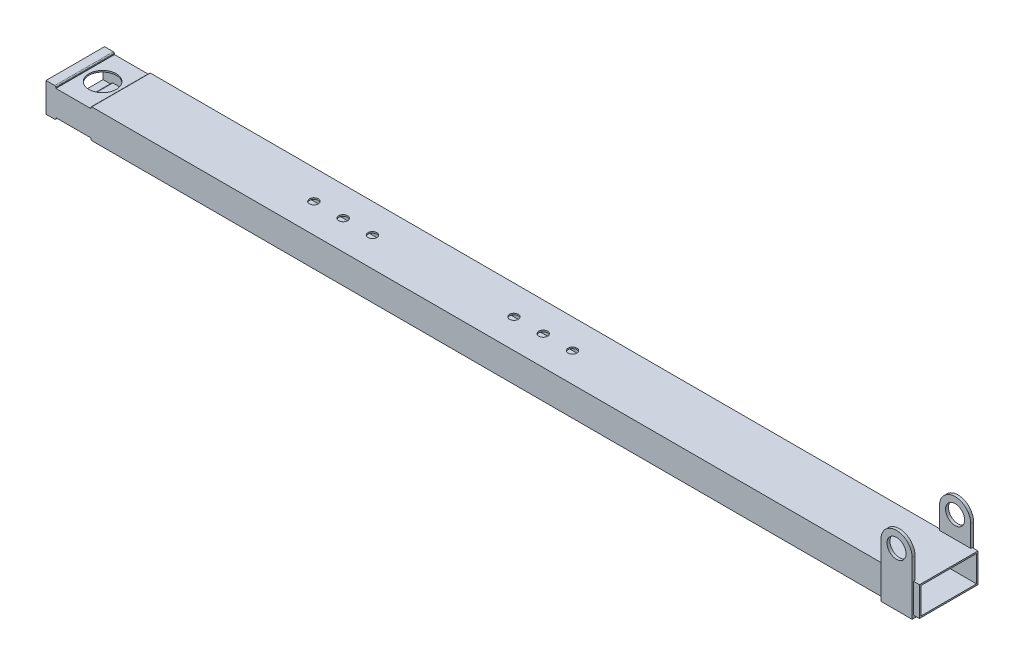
ISO-10303-21;
HEADER;
FILE_DESCRIPTION(('STEP AP214'),'2;1');
FILE_NAME('part.step','',(''),(''),'','','');
FILE_SCHEMA(('AUTOMOTIVE_DESIGN { 1 0 10303 214 1 1 1 1 }'));
ENDSEC;
DATA;
#1=APPLICATION_CONTEXT('core data for automotive mechanical design processes');
#2=APPLICATION_PROTOCOL_DEFINITION('international standard','automotive_design',2000,#1);
#3=PRODUCT_CONTEXT('',#1,'mechanical');
#4=PRODUCT('Part','Part','',(#3));
#5=PRODUCT_RELATED_PRODUCT_CATEGORY('part','',(#4));
#6=PRODUCT_DEFINITION_FORMATION('','',#4);
#7=PRODUCT_DEFINITION_CONTEXT('part definition',#1,'design');
#8=PRODUCT_DEFINITION('design','',#6,#7);
#9=PRODUCT_DEFINITION_SHAPE('','',#8);
#10=(LENGTH_UNIT() NAMED_UNIT(*) SI_UNIT(.MILLI.,.METRE.));
#11=(NAMED_UNIT(*) PLANE_ANGLE_UNIT() SI_UNIT($,.RADIAN.));
#12=(NAMED_UNIT(*) SI_UNIT($,.STERADIAN.) SOLID_ANGLE_UNIT());
#13=UNCERTAINTY_MEASURE_WITH_UNIT(LENGTH_MEASURE(1.E-05),#10,'distance_accuracy_value','');
#14=(GEOMETRIC_REPRESENTATION_CONTEXT(3) GLOBAL_UNCERTAINTY_ASSIGNED_CONTEXT((#13)) GLOBAL_UNIT_ASSIGNED_CONTEXT((#10,
#11,#12)) REPRESENTATION_CONTEXT('',''));
#15=CARTESIAN_POINT('',(0.,0.,0.));
#16=DIRECTION('',(0.,0.,1.));
#17=DIRECTION('',(1.,0.,0.));
#18=AXIS2_PLACEMENT_3D('',#15,#16,#17);
#19=CARTESIAN_POINT('',(-1884.72059780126,450.092409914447,-30.));
#20=DIRECTION('',(0.,0.,-1.));
#21=DIRECTION('',(-1.,0.,0.));
#22=AXIS2_PLACEMENT_3D('',#19,#20,#21);
#23=PLANE('',#22);
#24=DIRECTION('',(-1.,0.,0.));
#25=VECTOR('',#24,1.);
#26=CARTESIAN_POINT('',(-1846.72059780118,451.092409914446,-30.));
#27=LINE('',#26,#25);
#28=CARTESIAN_POINT('',(-1036.72059780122,451.092409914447,-30.));
#29=VERTEX_POINT('',#28);
#30=CARTESIAN_POINT('',(-1846.72059780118,451.092409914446,-30.));
#31=VERTEX_POINT('',#30);
#32=EDGE_CURVE('E599',#29,#31,#27,.T.);
#33=ORIENTED_EDGE('',*,*,#32,.F.);
#34=DIRECTION('',(0.,-1.,0.));
#35=VECTOR('',#34,1.);
#36=CARTESIAN_POINT('',(-1036.72059780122,450.092409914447,-30.));
#37=LINE('',#36,#35);
#38=CARTESIAN_POINT('',(-1036.72059780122,421.092409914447,-30.));
#39=VERTEX_POINT('',#38);
#40=EDGE_CURVE('E378',#29,#39,#37,.T.);
#41=ORIENTED_EDGE('',*,*,#40,.T.);
#42=DIRECTION('',(1.,0.,0.));
#43=VECTOR('',#42,1.);
#44=CARTESIAN_POINT('',(-1846.7205978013,421.092409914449,-30.));
#45=LINE('',#44,#43);
#46=CARTESIAN_POINT('',(-1846.7205978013,421.092409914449,-30.));
#47=VERTEX_POINT('',#46);
#48=EDGE_CURVE('E594',#47,#39,#45,.T.);
#49=ORIENTED_EDGE('',*,*,#48,.F.);
#50=CARTESIAN_POINT('',(-1846.7205978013,422.092409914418,-30.));
#51=DIRECTION('',(0.,0.,1.));
#52=DIRECTION('',(1.,0.,0.));
#53=AXIS2_PLACEMENT_3D('',#50,#51,#52);
#54=CIRCLE('',#53,0.999999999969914);
#55=CARTESIAN_POINT('',(-1847.72059780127,422.092409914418,-30.));
#56=VERTEX_POINT('',#55);
#57=EDGE_CURVE('E591',#56,#47,#54,.T.);
#58=ORIENTED_EDGE('',*,*,#57,.F.);
#59=DIRECTION('',(0.,-1.,0.));
#60=VECTOR('',#59,1.);
#61=CARTESIAN_POINT('',(-1847.72059780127,422.092409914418,-30.));
#62=LINE('',#61,#60);
#63=CARTESIAN_POINT('',(-1847.72059780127,422.892409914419,-30.));
#64=VERTEX_POINT('',#63);
#65=EDGE_CURVE('E589',#64,#56,#62,.T.);
#66=ORIENTED_EDGE('',*,*,#65,.F.);
#67=CARTESIAN_POINT('',(-1847.92059780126,422.892409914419,-30.));
#68=DIRECTION('',(0.,0.,-1.));
#69=DIRECTION('',(1.,0.,0.));
#70=AXIS2_PLACEMENT_3D('',#67,#68,#69);
#71=CIRCLE('',#70,0.199999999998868);
#72=CARTESIAN_POINT('',(-1847.92059780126,423.092409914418,-30.));
#73=VERTEX_POINT('',#72);
#74=EDGE_CURVE('E587',#73,#64,#71,.T.);
#75=ORIENTED_EDGE('',*,*,#74,.F.);
#76=DIRECTION('',(1.,0.,0.));
#77=VECTOR('',#76,1.);
#78=CARTESIAN_POINT('',(-1883.52059780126,423.092409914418,-30.));
#79=LINE('',#78,#77);
#80=CARTESIAN_POINT('',(-1883.52059780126,423.092409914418,-30.));
#81=VERTEX_POINT('',#80);
#82=EDGE_CURVE('E585',#81,#73,#79,.T.);
#83=ORIENTED_EDGE('',*,*,#82,.F.);
#84=CARTESIAN_POINT('',(-1883.52059780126,422.892409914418,-30.));
#85=DIRECTION('',(0.,0.,-1.));
#86=DIRECTION('',(1.,0.,0.));
#87=AXIS2_PLACEMENT_3D('',#84,#85,#86);
#88=CIRCLE('',#87,0.200000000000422);
#89=CARTESIAN_POINT('',(-1883.72059780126,422.892409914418,-30.));
#90=VERTEX_POINT('',#89);
#91=EDGE_CURVE('E583',#90,#81,#88,.T.);
#92=ORIENTED_EDGE('',*,*,#91,.F.);
#93=DIRECTION('',(0.,1.,0.));
#94=VECTOR('',#93,1.);
#95=CARTESIAN_POINT('',(-1883.72059780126,422.092409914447,-30.));
#96=LINE('',#95,#94);
#97=CARTESIAN_POINT('',(-1883.72059780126,422.092409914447,-30.));
#98=VERTEX_POINT('',#97);
#99=EDGE_CURVE('E581',#98,#90,#96,.T.);
#100=ORIENTED_EDGE('',*,*,#99,.F.);
#101=CARTESIAN_POINT('',(-1884.72059780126,422.092409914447,-30.));
#102=DIRECTION('',(0.,0.,1.));
#103=DIRECTION('',(1.,0.,0.));
#104=AXIS2_PLACEMENT_3D('',#101,#102,#103);
#105=CIRCLE('',#104,0.999999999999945);
#106=CARTESIAN_POINT('',(-1884.72059780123,421.092409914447,-30.));
#107=VERTEX_POINT('',#106);
#108=EDGE_CURVE('E579',#107,#98,#105,.T.);
#109=ORIENTED_EDGE('',*,*,#108,.F.);
#110=DIRECTION('',(1.,0.,0.));
#111=VECTOR('',#110,1.);
#112=CARTESIAN_POINT('',(-1893.72059780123,421.092409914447,-30.));
#113=LINE('',#112,#111);
#114=CARTESIAN_POINT('',(-1893.72059780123,421.092409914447,-30.));
#115=VERTEX_POINT('',#114);
#116=EDGE_CURVE('E577',#115,#107,#113,.T.);
#117=ORIENTED_EDGE('',*,*,#116,.F.);
#118=DIRECTION('',(0.,-1.,0.));
#119=VECTOR('',#118,1.);
#120=CARTESIAN_POINT('',(-1893.72059780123,451.092409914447,-30.));
#121=LINE('',#120,#119);
#122=CARTESIAN_POINT('',(-1893.72059780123,451.092409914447,-30.));
#123=VERTEX_POINT('',#122);
#124=EDGE_CURVE('E575',#123,#115,#121,.T.);
#125=ORIENTED_EDGE('',*,*,#124,.F.);
#126=DIRECTION('',(-1.,0.,0.));
#127=VECTOR('',#126,1.);
#128=CARTESIAN_POINT('',(-1893.72059780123,451.092409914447,-30.));
#129=LINE('',#128,#127);
#130=CARTESIAN_POINT('',(-1884.72059780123,451.092409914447,-30.));
#131=VERTEX_POINT('',#130);
#132=EDGE_CURVE('E573',#131,#123,#129,.T.);
#133=ORIENTED_EDGE('',*,*,#132,.F.);
#134=CARTESIAN_POINT('',(-1884.72059780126,450.092409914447,-30.));
#135=DIRECTION('',(0.,0.,1.));
#136=DIRECTION('',(-1.,0.,0.));
#137=AXIS2_PLACEMENT_3D('',#134,#135,#136);
#138=CIRCLE('',#137,0.999999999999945);
#139=CARTESIAN_POINT('',(-1883.72059780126,450.092409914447,-30.));
#140=VERTEX_POINT('',#139);
#141=EDGE_CURVE('E463',#140,#131,#138,.T.);
#142=ORIENTED_EDGE('',*,*,#141,.F.);
#143=DIRECTION('',(-7.38298311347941E-11,1.,0.));
#144=VECTOR('',#143,1.);
#145=CARTESIAN_POINT('',(-1883.72059780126,450.092409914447,-30.));
#146=LINE('',#145,#144);
#147=CARTESIAN_POINT('',(-1883.7205978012,449.292409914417,-30.));
#148=VERTEX_POINT('',#147);
#149=EDGE_CURVE('E613',#148,#140,#146,.T.);
#150=ORIENTED_EDGE('',*,*,#149,.F.);
#151=CARTESIAN_POINT('',(-1883.5205978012,449.292409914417,-30.));
#152=DIRECTION('',(0.,0.,-1.));
#153=DIRECTION('',(1.,0.,0.));
#154=AXIS2_PLACEMENT_3D('',#151,#152,#153);
#155=CIRCLE('',#154,0.199999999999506);
#156=CARTESIAN_POINT('',(-1883.5205978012,449.092409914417,-30.));
#157=VERTEX_POINT('',#156);
#158=EDGE_CURVE('E611',#157,#148,#155,.T.);
#159=ORIENTED_EDGE('',*,*,#158,.F.);
#160=DIRECTION('',(-1.,0.,0.));
#161=VECTOR('',#160,1.);
#162=CARTESIAN_POINT('',(-1883.5205978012,449.092409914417,-30.));
#163=LINE('',#162,#161);
#164=CARTESIAN_POINT('',(-1847.92059780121,449.092409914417,-30.));
#165=VERTEX_POINT('',#164);
#166=EDGE_CURVE('E609',#165,#157,#163,.T.);
#167=ORIENTED_EDGE('',*,*,#166,.F.);
#168=CARTESIAN_POINT('',(-1847.92059780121,449.292409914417,-30.));
#169=DIRECTION('',(0.,0.,-1.));
#170=DIRECTION('',(1.,0.,0.));
#171=AXIS2_PLACEMENT_3D('',#168,#169,#170);
#172=CIRCLE('',#171,0.199999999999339);
#173=CARTESIAN_POINT('',(-1847.72059780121,449.292409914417,-30.));
#174=VERTEX_POINT('',#173);
#175=EDGE_CURVE('E607',#174,#165,#172,.T.);
#176=ORIENTED_EDGE('',*,*,#175,.F.);
#177=DIRECTION('',(0.,-1.,0.));
#178=VECTOR('',#177,1.);
#179=CARTESIAN_POINT('',(-1847.72059780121,450.092409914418,-30.));
#180=LINE('',#179,#178);
#181=CARTESIAN_POINT('',(-1847.72059780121,450.092409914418,-30.));
#182=VERTEX_POINT('',#181);
#183=EDGE_CURVE('E605',#182,#174,#180,.T.);
#184=ORIENTED_EDGE('',*,*,#183,.F.);
#185=CARTESIAN_POINT('',(-1846.72059780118,450.092409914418,-30.));
#186=DIRECTION('',(0.,0.,1.));
#187=DIRECTION('',(1.,0.,0.));
#188=AXIS2_PLACEMENT_3D('',#185,#186,#187);
#189=CIRCLE('',#188,1.00000000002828);
#190=EDGE_CURVE('E603',#31,#182,#189,.T.);
#191=ORIENTED_EDGE('',*,*,#190,.F.);
#192=EDGE_LOOP('',(#33,#41,#49,#58,#66,#75,#83,#92,#100,#109,#117,#125,#133,#142,#150,#159,#167,
#176,#184,#191));
#193=FACE_BOUND('',#192,.T.);
#194=ADVANCED_FACE('F16',(#193),#23,.T.);
#195=CARTESIAN_POINT('',(-1004.72059780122,421.092409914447,-30.));
#196=VERTEX_POINT('',#195);
#197=CARTESIAN_POINT('',(-998.720597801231,421.092409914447,-30.));
#198=VERTEX_POINT('',#197);
#199=EDGE_CURVE('E593',#196,#198,#45,.T.);
#200=ORIENTED_EDGE('',*,*,#199,.F.);
#201=DIRECTION('',(0.,-1.,0.));
#202=VECTOR('',#201,1.);
#203=CARTESIAN_POINT('',(-1004.72059780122,450.092409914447,-30.));
#204=LINE('',#203,#202);
#205=CARTESIAN_POINT('',(-1004.72059780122,451.092409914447,-30.));
#206=VERTEX_POINT('',#205);
#207=EDGE_CURVE('E11',#206,#196,#204,.T.);
#208=ORIENTED_EDGE('',*,*,#207,.F.);
#209=CARTESIAN_POINT('',(-998.720597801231,451.092409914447,-30.));
#210=VERTEX_POINT('',#209);
#211=EDGE_CURVE('E600',#210,#206,#27,.T.);
#212=ORIENTED_EDGE('',*,*,#211,.F.);
#213=DIRECTION('',(0.,1.,0.));
#214=VECTOR('',#213,1.);
#215=CARTESIAN_POINT('',(-998.720597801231,451.092409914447,-30.));
#216=LINE('',#215,#214);
#217=EDGE_CURVE('E597',#198,#210,#216,.T.);
#218=ORIENTED_EDGE('',*,*,#217,.F.);
#219=EDGE_LOOP('',(#200,#208,#212,#218));
#220=FACE_BOUND('',#219,.T.);
#221=ADVANCED_FACE('F830',(#220),#23,.T.);
#222=CARTESIAN_POINT('',(-1846.7205978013,421.092409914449,30.));
#223=DIRECTION('',(0.,1.,0.));
#224=DIRECTION('',(-1.,0.,0.));
#225=AXIS2_PLACEMENT_3D('',#222,#223,#224);
#226=PLANE('',#225);
#227=CARTESIAN_POINT('',(-1589.22059780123,421.092409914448,-1.0833990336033E-11));
#228=DIRECTION('',(0.,1.,0.));
#229=DIRECTION('',(-1.,0.,0.));
#230=AXIS2_PLACEMENT_3D('',#227,#228,#229);
#231=CIRCLE('',#230,4.50000000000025);
#232=CARTESIAN_POINT('',(-1593.72059780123,421.092409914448,-1.0833990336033E-11));
#233=VERTEX_POINT('',#232);
#234=EDGE_CURVE('E442',#233,#233,#231,.T.);
#235=ORIENTED_EDGE('',*,*,#234,.T.);
#236=EDGE_LOOP('',(#235));
#237=FACE_BOUND('',#236,.T.);
#238=CARTESIAN_POINT('',(-1619.22059780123,421.092409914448,-1.06188846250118E-11));
#239=DIRECTION('',(0.,1.,0.));
#240=DIRECTION('',(-1.,0.,0.));
#241=AXIS2_PLACEMENT_3D('',#238,#239,#240);
#242=CIRCLE('',#241,4.50000000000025);
#243=CARTESIAN_POINT('',(-1623.72059780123,421.092409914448,-1.06188846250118E-11));
#244=VERTEX_POINT('',#243);
#245=EDGE_CURVE('E432',#244,#244,#242,.T.);
#246=ORIENTED_EDGE('',*,*,#245,.T.);
#247=EDGE_LOOP('',(#246));
#248=FACE_BOUND('',#247,.T.);
#249=CARTESIAN_POINT('',(-1649.22059780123,421.092409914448,-1.04107178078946E-11));
#250=DIRECTION('',(0.,1.,0.));
#251=DIRECTION('',(-1.,0.,0.));
#252=AXIS2_PLACEMENT_3D('',#249,#250,#251);
#253=CIRCLE('',#252,4.49999999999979);
#254=CARTESIAN_POINT('',(-1653.72059780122,421.092409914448,-1.04107178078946E-11));
#255=VERTEX_POINT('',#254);
#256=EDGE_CURVE('E422',#255,#255,#253,.T.);
#257=ORIENTED_EDGE('',*,*,#256,.T.);
#258=EDGE_LOOP('',(#257));
#259=FACE_BOUND('',#258,.T.);
#260=CARTESIAN_POINT('',(-1444.22059780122,421.092409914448,-2.74324004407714E-12));
#261=DIRECTION('',(0.,1.,0.));
#262=DIRECTION('',(-1.,0.,0.));
#263=AXIS2_PLACEMENT_3D('',#260,#261,#262);
#264=CIRCLE('',#263,4.49999999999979);
#265=CARTESIAN_POINT('',(-1448.72059780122,421.092409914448,-2.74324004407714E-12));
#266=VERTEX_POINT('',#265);
#267=EDGE_CURVE('E412',#266,#266,#264,.T.);
#268=ORIENTED_EDGE('',*,*,#267,.T.);
#269=EDGE_LOOP('',(#268));
#270=FACE_BOUND('',#269,.T.);
#271=CARTESIAN_POINT('',(-1414.22059780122,421.092409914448,-2.95140686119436E-12));
#272=DIRECTION('',(0.,1.,0.));
#273=DIRECTION('',(-1.,0.,0.));
#274=AXIS2_PLACEMENT_3D('',#271,#272,#273);
#275=CIRCLE('',#274,4.50000000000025);
#276=CARTESIAN_POINT('',(-1418.72059780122,421.092409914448,-2.95140686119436E-12));
#277=VERTEX_POINT('',#276);
#278=EDGE_CURVE('E402',#277,#277,#275,.T.);
#279=ORIENTED_EDGE('',*,*,#278,.T.);
#280=EDGE_LOOP('',(#279));
#281=FACE_BOUND('',#280,.T.);
#282=CARTESIAN_POINT('',(-1384.22059780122,421.092409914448,-3.15957367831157E-12));
#283=DIRECTION('',(0.,1.,0.));
#284=DIRECTION('',(-1.,0.,0.));
#285=AXIS2_PLACEMENT_3D('',#282,#283,#284);
#286=CIRCLE('',#285,4.49999999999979);
#287=CARTESIAN_POINT('',(-1388.72059780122,421.092409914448,-3.15957367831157E-12));
#288=VERTEX_POINT('',#287);
#289=EDGE_CURVE('E392',#288,#288,#286,.T.);
#290=ORIENTED_EDGE('',*,*,#289,.T.);
#291=EDGE_LOOP('',(#290));
#292=FACE_BOUND('',#291,.T.);
#293=DIRECTION('',(0.,0.,-1.));
#294=VECTOR('',#293,1.);
#295=CARTESIAN_POINT('',(-1036.72059780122,421.092409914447,30.));
#296=LINE('',#295,#294);
#297=CARTESIAN_POINT('',(-1036.72059780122,421.092409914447,30.));
#298=VERTEX_POINT('',#297);
#299=EDGE_CURVE('E376',#298,#39,#296,.T.);
#300=ORIENTED_EDGE('',*,*,#299,.F.);
#301=DIRECTION('',(1.,0.,0.));
#302=VECTOR('',#301,1.);
#303=CARTESIAN_POINT('',(-1846.7205978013,421.092409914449,30.));
#304=LINE('',#303,#302);
#305=CARTESIAN_POINT('',(-1846.7205978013,421.092409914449,30.));
#306=VERTEX_POINT('',#305);
#307=EDGE_CURVE('E639',#306,#298,#304,.T.);
#308=ORIENTED_EDGE('',*,*,#307,.F.);
#309=DIRECTION('',(0.,0.,-1.));
#310=VECTOR('',#309,1.);
#311=CARTESIAN_POINT('',(-1846.7205978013,421.092409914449,30.));
#312=LINE('',#311,#310);
#313=EDGE_CURVE('E687',#306,#47,#312,.T.);
#314=ORIENTED_EDGE('',*,*,#313,.T.);
#315=ORIENTED_EDGE('',*,*,#48,.T.);
#316=EDGE_LOOP('',(#300,#308,#314,#315));
#317=FACE_BOUND('',#316,.T.);
#318=ADVANCED_FACE('F836',(#237,#248,#259,#270,#281,#292,#317),#226,.F.);
#319=DIRECTION('',(0.,0.,1.));
#320=VECTOR('',#319,1.);
#321=CARTESIAN_POINT('',(-1004.72059780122,421.092409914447,30.));
#322=LINE('',#321,#320);
#323=CARTESIAN_POINT('',(-1004.72059780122,421.092409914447,30.));
#324=VERTEX_POINT('',#323);
#325=EDGE_CURVE('E369',#196,#324,#322,.T.);
#326=ORIENTED_EDGE('',*,*,#325,.F.);
#327=ORIENTED_EDGE('',*,*,#199,.T.);
#328=DIRECTION('',(0.,0.,-1.));
#329=VECTOR('',#328,1.);
#330=CARTESIAN_POINT('',(-998.720597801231,421.092409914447,30.));
#331=LINE('',#330,#329);
#332=CARTESIAN_POINT('',(-998.720597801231,421.092409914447,30.));
#333=VERTEX_POINT('',#332);
#334=EDGE_CURVE('E684',#333,#198,#331,.T.);
#335=ORIENTED_EDGE('',*,*,#334,.F.);
#336=EDGE_CURVE('E638',#324,#333,#304,.T.);
#337=ORIENTED_EDGE('',*,*,#336,.F.);
#338=EDGE_LOOP('',(#326,#327,#335,#337));
#339=FACE_BOUND('',#338,.T.);
#340=ADVANCED_FACE('F875',(#339),#226,.F.);
#341=CARTESIAN_POINT('',(-1846.72059780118,451.092409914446,30.));
#342=DIRECTION('',(0.,-1.,0.));
#343=DIRECTION('',(1.,0.,0.));
#344=AXIS2_PLACEMENT_3D('',#341,#342,#343);
#345=PLANE('',#344);
#346=CARTESIAN_POINT('',(-1384.22059780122,451.092409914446,-3.15957367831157E-12));
#347=DIRECTION('',(0.,1.,0.));
#348=DIRECTION('',(-1.,0.,0.));
#349=AXIS2_PLACEMENT_3D('',#346,#347,#348);
#350=CIRCLE('',#349,4.49999999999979);
#351=CARTESIAN_POINT('',(-1388.72059780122,451.092409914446,-3.15957367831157E-12));
#352=VERTEX_POINT('',#351);
#353=EDGE_CURVE('E385',#352,#352,#350,.T.);
#354=ORIENTED_EDGE('',*,*,#353,.F.);
#355=EDGE_LOOP('',(#354));
#356=FACE_BOUND('',#355,.T.);
#357=CARTESIAN_POINT('',(-1414.22059780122,451.092409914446,-2.95140686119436E-12));
#358=DIRECTION('',(0.,1.,0.));
#359=DIRECTION('',(-1.,0.,0.));
#360=AXIS2_PLACEMENT_3D('',#357,#358,#359);
#361=CIRCLE('',#360,4.50000000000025);
#362=CARTESIAN_POINT('',(-1418.72059780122,451.092409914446,-2.95140686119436E-12));
#363=VERTEX_POINT('',#362);
#364=EDGE_CURVE('E395',#363,#363,#361,.T.);
#365=ORIENTED_EDGE('',*,*,#364,.F.);
#366=EDGE_LOOP('',(#365));
#367=FACE_BOUND('',#366,.T.);
#368=CARTESIAN_POINT('',(-1444.22059780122,451.092409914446,-2.74324004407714E-12));
#369=DIRECTION('',(0.,1.,0.));
#370=DIRECTION('',(-1.,0.,0.));
#371=AXIS2_PLACEMENT_3D('',#368,#369,#370);
#372=CIRCLE('',#371,4.49999999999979);
#373=CARTESIAN_POINT('',(-1448.72059780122,451.092409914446,-2.74324004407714E-12));
#374=VERTEX_POINT('',#373);
#375=EDGE_CURVE('E405',#374,#374,#372,.T.);
#376=ORIENTED_EDGE('',*,*,#375,.F.);
#377=EDGE_LOOP('',(#376));
#378=FACE_BOUND('',#377,.T.);
#379=CARTESIAN_POINT('',(-1649.22059780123,451.092409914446,-1.04107178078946E-11));
#380=DIRECTION('',(0.,1.,0.));
#381=DIRECTION('',(-1.,0.,0.));
#382=AXIS2_PLACEMENT_3D('',#379,#380,#381);
#383=CIRCLE('',#382,4.49999999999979);
#384=CARTESIAN_POINT('',(-1653.72059780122,451.092409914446,-1.04107178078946E-11));
#385=VERTEX_POINT('',#384);
#386=EDGE_CURVE('E415',#385,#385,#383,.T.);
#387=ORIENTED_EDGE('',*,*,#386,.F.);
#388=EDGE_LOOP('',(#387));
#389=FACE_BOUND('',#388,.T.);
#390=CARTESIAN_POINT('',(-1619.22059780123,451.092409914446,-1.06188846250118E-11));
#391=DIRECTION('',(0.,1.,0.));
#392=DIRECTION('',(-1.,0.,0.));
#393=AXIS2_PLACEMENT_3D('',#390,#391,#392);
#394=CIRCLE('',#393,4.50000000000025);
#395=CARTESIAN_POINT('',(-1623.72059780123,451.092409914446,-1.06188846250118E-11));
#396=VERTEX_POINT('',#395);
#397=EDGE_CURVE('E425',#396,#396,#394,.T.);
#398=ORIENTED_EDGE('',*,*,#397,.F.);
#399=EDGE_LOOP('',(#398));
#400=FACE_BOUND('',#399,.T.);
#401=CARTESIAN_POINT('',(-1589.22059780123,451.092409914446,-1.0833990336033E-11));
#402=DIRECTION('',(0.,1.,0.));
#403=DIRECTION('',(-1.,0.,0.));
#404=AXIS2_PLACEMENT_3D('',#401,#402,#403);
#405=CIRCLE('',#404,4.50000000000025);
#406=CARTESIAN_POINT('',(-1593.72059780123,451.092409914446,-1.0833990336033E-11));
#407=VERTEX_POINT('',#406);
#408=EDGE_CURVE('E435',#407,#407,#405,.T.);
#409=ORIENTED_EDGE('',*,*,#408,.F.);
#410=EDGE_LOOP('',(#409));
#411=FACE_BOUND('',#410,.T.);
#412=DIRECTION('',(0.,0.,1.));
#413=VECTOR('',#412,1.);
#414=CARTESIAN_POINT('',(-1036.72059780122,451.092409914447,30.));
#415=LINE('',#414,#413);
#416=CARTESIAN_POINT('',(-1036.72059780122,451.092409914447,-28.5));
#417=VERTEX_POINT('',#416);
#418=EDGE_CURVE('E375',#29,#417,#415,.T.);
#419=ORIENTED_EDGE('',*,*,#418,.F.);
#420=ORIENTED_EDGE('',*,*,#32,.T.);
#421=DIRECTION('',(0.,0.,-1.));
#422=VECTOR('',#421,1.);
#423=CARTESIAN_POINT('',(-1846.72059780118,451.092409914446,30.));
#424=LINE('',#423,#422);
#425=CARTESIAN_POINT('',(-1846.72059780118,451.092409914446,30.));
#426=VERTEX_POINT('',#425);
#427=EDGE_CURVE('E678',#426,#31,#424,.T.);
#428=ORIENTED_EDGE('',*,*,#427,.F.);
#429=DIRECTION('',(-1.,0.,0.));
#430=VECTOR('',#429,1.);
#431=CARTESIAN_POINT('',(-1846.72059780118,451.092409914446,30.));
#432=LINE('',#431,#430);
#433=CARTESIAN_POINT('',(-1036.72059780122,451.092409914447,30.));
#434=VERTEX_POINT('',#433);
#435=EDGE_CURVE('E644',#434,#426,#432,.T.);
#436=ORIENTED_EDGE('',*,*,#435,.F.);
#437=CARTESIAN_POINT('',(-1036.72059780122,451.092409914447,28.5));
#438=VERTEX_POINT('',#437);
#439=EDGE_CURVE('E373',#438,#434,#415,.T.);
#440=ORIENTED_EDGE('',*,*,#439,.F.);
#441=DIRECTION('',(-1.,0.,0.));
#442=VECTOR('',#441,1.);
#443=CARTESIAN_POINT('',(-1846.72059780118,451.092409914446,28.5));
#444=LINE('',#443,#442);
#445=CARTESIAN_POINT('',(-1004.72059780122,451.092409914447,28.5));
#446=VERTEX_POINT('',#445);
#447=EDGE_CURVE('E329',#446,#438,#444,.T.);
#448=ORIENTED_EDGE('',*,*,#447,.F.);
#449=DIRECTION('',(0.,0.,-1.));
#450=VECTOR('',#449,1.);
#451=CARTESIAN_POINT('',(-1004.72059780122,451.092409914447,30.));
#452=LINE('',#451,#450);
#453=CARTESIAN_POINT('',(-1004.72059780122,451.092409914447,30.));
#454=VERTEX_POINT('',#453);
#455=EDGE_CURVE('E355',#454,#446,#452,.T.);
#456=ORIENTED_EDGE('',*,*,#455,.F.);
#457=CARTESIAN_POINT('',(-998.720597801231,451.092409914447,30.));
#458=VERTEX_POINT('',#457);
#459=EDGE_CURVE('E645',#458,#454,#432,.T.);
#460=ORIENTED_EDGE('',*,*,#459,.F.);
#461=DIRECTION('',(0.,0.,-1.));
#462=VECTOR('',#461,1.);
#463=CARTESIAN_POINT('',(-998.720597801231,451.092409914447,30.));
#464=LINE('',#463,#462);
#465=EDGE_CURVE('E681',#458,#210,#464,.T.);
#466=ORIENTED_EDGE('',*,*,#465,.T.);
#467=ORIENTED_EDGE('',*,*,#211,.T.);
#468=CARTESIAN_POINT('',(-1004.72059780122,451.092409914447,-28.5));
#469=VERTEX_POINT('',#468);
#470=EDGE_CURVE('E349',#469,#206,#452,.T.);
#471=ORIENTED_EDGE('',*,*,#470,.F.);
#472=DIRECTION('',(-1.,0.,0.));
#473=VECTOR('',#472,1.);
#474=CARTESIAN_POINT('',(-1846.72059780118,451.092409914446,-28.5));
#475=LINE('',#474,#473);
#476=EDGE_CURVE('E382',#469,#417,#475,.T.);
#477=ORIENTED_EDGE('',*,*,#476,.T.);
#478=EDGE_LOOP('',(#419,#420,#428,#436,#440,#448,#456,#460,#466,#467,#471,#477));
#479=FACE_BOUND('',#478,.T.);
#480=ADVANCED_FACE('F846',(#356,#367,#378,#389,#400,#411,#479),#345,.F.);
#481=CARTESIAN_POINT('',(-1884.72059780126,450.092409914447,30.));
#482=DIRECTION('',(0.,0.,-1.));
#483=DIRECTION('',(-1.,0.,0.));
#484=AXIS2_PLACEMENT_3D('',#481,#482,#483);
#485=PLANE('',#484);
#486=DIRECTION('',(0.,-1.,0.));
#487=VECTOR('',#486,1.);
#488=CARTESIAN_POINT('',(-1036.72059780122,450.092409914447,30.));
#489=LINE('',#488,#487);
#490=EDGE_CURVE('E371',#434,#298,#489,.T.);
#491=ORIENTED_EDGE('',*,*,#490,.F.);
#492=ORIENTED_EDGE('',*,*,#435,.T.);
#493=CARTESIAN_POINT('',(-1846.72059780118,450.092409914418,30.));
#494=DIRECTION('',(0.,0.,1.));
#495=DIRECTION('',(1.,0.,0.));
#496=AXIS2_PLACEMENT_3D('',#493,#494,#495);
#497=CIRCLE('',#496,1.00000000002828);
#498=CARTESIAN_POINT('',(-1847.72059780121,450.092409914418,30.));
#499=VERTEX_POINT('',#498);
#500=EDGE_CURVE('E648',#426,#499,#497,.T.);
#501=ORIENTED_EDGE('',*,*,#500,.T.);
#502=DIRECTION('',(0.,-1.,0.));
#503=VECTOR('',#502,1.);
#504=CARTESIAN_POINT('',(-1847.72059780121,450.092409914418,30.));
#505=LINE('',#504,#503);
#506=CARTESIAN_POINT('',(-1847.72059780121,449.292409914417,30.));
#507=VERTEX_POINT('',#506);
#508=EDGE_CURVE('E650',#499,#507,#505,.T.);
#509=ORIENTED_EDGE('',*,*,#508,.T.);
#510=CARTESIAN_POINT('',(-1847.92059780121,449.292409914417,30.));
#511=DIRECTION('',(0.,0.,-1.));
#512=DIRECTION('',(1.,0.,0.));
#513=AXIS2_PLACEMENT_3D('',#510,#511,#512);
#514=CIRCLE('',#513,0.199999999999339);
#515=CARTESIAN_POINT('',(-1847.92059780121,449.092409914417,30.));
#516=VERTEX_POINT('',#515);
#517=EDGE_CURVE('E652',#507,#516,#514,.T.);
#518=ORIENTED_EDGE('',*,*,#517,.T.);
#519=DIRECTION('',(-1.,0.,0.));
#520=VECTOR('',#519,1.);
#521=CARTESIAN_POINT('',(-1883.5205978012,449.092409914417,30.));
#522=LINE('',#521,#520);
#523=CARTESIAN_POINT('',(-1883.5205978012,449.092409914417,30.));
#524=VERTEX_POINT('',#523);
#525=EDGE_CURVE('E654',#516,#524,#522,.T.);
#526=ORIENTED_EDGE('',*,*,#525,.T.);
#527=CARTESIAN_POINT('',(-1883.5205978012,449.292409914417,30.));
#528=DIRECTION('',(0.,0.,-1.));
#529=DIRECTION('',(1.,0.,0.));
#530=AXIS2_PLACEMENT_3D('',#527,#528,#529);
#531=CIRCLE('',#530,0.199999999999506);
#532=CARTESIAN_POINT('',(-1883.7205978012,449.292409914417,30.));
#533=VERTEX_POINT('',#532);
#534=EDGE_CURVE('E656',#524,#533,#531,.T.);
#535=ORIENTED_EDGE('',*,*,#534,.T.);
#536=DIRECTION('',(-7.38298311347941E-11,1.,0.));
#537=VECTOR('',#536,1.);
#538=CARTESIAN_POINT('',(-1883.72059780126,450.092409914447,30.));
#539=LINE('',#538,#537);
#540=CARTESIAN_POINT('',(-1883.72059780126,450.092409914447,30.));
#541=VERTEX_POINT('',#540);
#542=EDGE_CURVE('E658',#533,#541,#539,.T.);
#543=ORIENTED_EDGE('',*,*,#542,.T.);
#544=CARTESIAN_POINT('',(-1884.72059780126,450.092409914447,30.));
#545=DIRECTION('',(0.,0.,1.));
#546=DIRECTION('',(-1.,0.,0.));
#547=AXIS2_PLACEMENT_3D('',#544,#545,#546);
#548=CIRCLE('',#547,0.999999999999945);
#549=CARTESIAN_POINT('',(-1884.72059780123,451.092409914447,30.));
#550=VERTEX_POINT('',#549);
#551=EDGE_CURVE('E615',#541,#550,#548,.T.);
#552=ORIENTED_EDGE('',*,*,#551,.T.);
#553=DIRECTION('',(-1.,0.,0.));
#554=VECTOR('',#553,1.);
#555=CARTESIAN_POINT('',(-1893.72059780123,451.092409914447,30.));
#556=LINE('',#555,#554);
#557=CARTESIAN_POINT('',(-1893.72059780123,451.092409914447,30.));
#558=VERTEX_POINT('',#557);
#559=EDGE_CURVE('E618',#550,#558,#556,.T.);
#560=ORIENTED_EDGE('',*,*,#559,.T.);
#561=DIRECTION('',(0.,-1.,0.));
#562=VECTOR('',#561,1.);
#563=CARTESIAN_POINT('',(-1893.72059780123,451.092409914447,30.));
#564=LINE('',#563,#562);
#565=CARTESIAN_POINT('',(-1893.72059780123,421.092409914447,30.));
#566=VERTEX_POINT('',#565);
#567=EDGE_CURVE('E620',#558,#566,#564,.T.);
#568=ORIENTED_EDGE('',*,*,#567,.T.);
#569=DIRECTION('',(1.,0.,0.));
#570=VECTOR('',#569,1.);
#571=CARTESIAN_POINT('',(-1893.72059780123,421.092409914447,30.));
#572=LINE('',#571,#570);
#573=CARTESIAN_POINT('',(-1884.72059780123,421.092409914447,30.));
#574=VERTEX_POINT('',#573);
#575=EDGE_CURVE('E622',#566,#574,#572,.T.);
#576=ORIENTED_EDGE('',*,*,#575,.T.);
#577=CARTESIAN_POINT('',(-1884.72059780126,422.092409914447,30.));
#578=DIRECTION('',(0.,0.,1.));
#579=DIRECTION('',(1.,0.,0.));
#580=AXIS2_PLACEMENT_3D('',#577,#578,#579);
#581=CIRCLE('',#580,0.999999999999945);
#582=CARTESIAN_POINT('',(-1883.72059780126,422.092409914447,30.));
#583=VERTEX_POINT('',#582);
#584=EDGE_CURVE('E624',#574,#583,#581,.T.);
#585=ORIENTED_EDGE('',*,*,#584,.T.);
#586=DIRECTION('',(0.,1.,0.));
#587=VECTOR('',#586,1.);
#588=CARTESIAN_POINT('',(-1883.72059780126,422.092409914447,30.));
#589=LINE('',#588,#587);
#590=CARTESIAN_POINT('',(-1883.72059780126,422.892409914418,30.));
#591=VERTEX_POINT('',#590);
#592=EDGE_CURVE('E626',#583,#591,#589,.T.);
#593=ORIENTED_EDGE('',*,*,#592,.T.);
#594=CARTESIAN_POINT('',(-1883.52059780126,422.892409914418,30.));
#595=DIRECTION('',(0.,0.,-1.));
#596=DIRECTION('',(1.,0.,0.));
#597=AXIS2_PLACEMENT_3D('',#594,#595,#596);
#598=CIRCLE('',#597,0.200000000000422);
#599=CARTESIAN_POINT('',(-1883.52059780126,423.092409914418,30.));
#600=VERTEX_POINT('',#599);
#601=EDGE_CURVE('E628',#591,#600,#598,.T.);
#602=ORIENTED_EDGE('',*,*,#601,.T.);
#603=DIRECTION('',(1.,0.,0.));
#604=VECTOR('',#603,1.);
#605=CARTESIAN_POINT('',(-1883.52059780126,423.092409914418,30.));
#606=LINE('',#605,#604);
#607=CARTESIAN_POINT('',(-1847.92059780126,423.092409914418,30.));
#608=VERTEX_POINT('',#607);
#609=EDGE_CURVE('E630',#600,#608,#606,.T.);
#610=ORIENTED_EDGE('',*,*,#609,.T.);
#611=CARTESIAN_POINT('',(-1847.92059780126,422.892409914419,30.));
#612=DIRECTION('',(0.,0.,-1.));
#613=DIRECTION('',(1.,0.,0.));
#614=AXIS2_PLACEMENT_3D('',#611,#612,#613);
#615=CIRCLE('',#614,0.199999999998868);
#616=CARTESIAN_POINT('',(-1847.72059780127,422.892409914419,30.));
#617=VERTEX_POINT('',#616);
#618=EDGE_CURVE('E632',#608,#617,#615,.T.);
#619=ORIENTED_EDGE('',*,*,#618,.T.);
#620=DIRECTION('',(0.,-1.,0.));
#621=VECTOR('',#620,1.);
#622=CARTESIAN_POINT('',(-1847.72059780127,422.092409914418,30.));
#623=LINE('',#622,#621);
#624=CARTESIAN_POINT('',(-1847.72059780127,422.092409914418,30.));
#625=VERTEX_POINT('',#624);
#626=EDGE_CURVE('E634',#617,#625,#623,.T.);
#627=ORIENTED_EDGE('',*,*,#626,.T.);
#628=CARTESIAN_POINT('',(-1846.7205978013,422.092409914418,30.));
#629=DIRECTION('',(0.,0.,1.));
#630=DIRECTION('',(1.,0.,0.));
#631=AXIS2_PLACEMENT_3D('',#628,#629,#630);
#632=CIRCLE('',#631,0.999999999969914);
#633=EDGE_CURVE('E636',#625,#306,#632,.T.);
#634=ORIENTED_EDGE('',*,*,#633,.T.);
#635=ORIENTED_EDGE('',*,*,#307,.T.);
#636=EDGE_LOOP('',(#491,#492,#501,#509,#518,#526,#535,#543,#552,#560,#568,#576,#585,#593,#602,
#610,#619,#627,#634,#635));
#637=FACE_BOUND('',#636,.T.);
#638=ADVANCED_FACE('F842',(#637),#485,.F.);
#639=DIRECTION('',(0.,1.,0.));
#640=VECTOR('',#639,1.);
#641=CARTESIAN_POINT('',(-1004.72059780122,450.092409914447,30.));
#642=LINE('',#641,#640);
#643=EDGE_CURVE('E353',#324,#454,#642,.T.);
#644=ORIENTED_EDGE('',*,*,#643,.F.);
#645=ORIENTED_EDGE('',*,*,#336,.T.);
#646=DIRECTION('',(0.,1.,0.));
#647=VECTOR('',#646,1.);
#648=CARTESIAN_POINT('',(-998.720597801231,451.092409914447,30.));
#649=LINE('',#648,#647);
#650=EDGE_CURVE('E642',#333,#458,#649,.T.);
#651=ORIENTED_EDGE('',*,*,#650,.T.);
#652=ORIENTED_EDGE('',*,*,#459,.T.);
#653=EDGE_LOOP('',(#644,#645,#651,#652));
#654=FACE_BOUND('',#653,.T.);
#655=ADVANCED_FACE('F845',(#654),#485,.F.);
#656=CARTESIAN_POINT('',(-1893.72059780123,451.092409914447,30.));
#657=DIRECTION('',(1.,0.,0.));
#658=DIRECTION('',(0.,0.,-1.));
#659=AXIS2_PLACEMENT_3D('',#656,#657,#658);
#660=PLANE('',#659);
#661=ORIENTED_EDGE('',*,*,#124,.T.);
#662=DIRECTION('',(0.,0.,-1.));
#663=VECTOR('',#662,1.);
#664=CARTESIAN_POINT('',(-1893.72059780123,421.092409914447,30.));
#665=LINE('',#664,#663);
#666=EDGE_CURVE('E711',#566,#115,#665,.T.);
#667=ORIENTED_EDGE('',*,*,#666,.F.);
#668=ORIENTED_EDGE('',*,*,#567,.F.);
#669=DIRECTION('',(0.,0.,-1.));
#670=VECTOR('',#669,1.);
#671=CARTESIAN_POINT('',(-1893.72059780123,451.092409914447,30.));
#672=LINE('',#671,#670);
#673=EDGE_CURVE('E714',#558,#123,#672,.T.);
#674=ORIENTED_EDGE('',*,*,#673,.T.);
#675=EDGE_LOOP('',(#661,#667,#668,#674));
#676=FACE_BOUND('',#675,.T.);
#677=DIRECTION('',(0.,-1.,0.));
#678=VECTOR('',#677,1.);
#679=CARTESIAN_POINT('',(-1893.72059780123,450.092409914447,-28.5));
#680=LINE('',#679,#678);
#681=CARTESIAN_POINT('',(-1893.72059780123,449.592409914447,-28.5));
#682=VERTEX_POINT('',#681);
#683=CARTESIAN_POINT('',(-1893.72059780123,422.592409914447,-28.5));
#684=VERTEX_POINT('',#683);
#685=EDGE_CURVE('E457',#682,#684,#680,.T.);
#686=ORIENTED_EDGE('',*,*,#685,.F.);
#687=DIRECTION('',(0.,0.,-1.));
#688=VECTOR('',#687,1.);
#689=CARTESIAN_POINT('',(-1893.72059780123,449.592409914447,30.));
#690=LINE('',#689,#688);
#691=CARTESIAN_POINT('',(-1893.72059780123,449.592409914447,28.5));
#692=VERTEX_POINT('',#691);
#693=EDGE_CURVE('E464',#692,#682,#690,.T.);
#694=ORIENTED_EDGE('',*,*,#693,.F.);
#695=DIRECTION('',(0.,-1.,0.));
#696=VECTOR('',#695,1.);
#697=CARTESIAN_POINT('',(-1893.72059780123,450.092409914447,28.5));
#698=LINE('',#697,#696);
#699=CARTESIAN_POINT('',(-1893.72059780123,422.592409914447,28.5));
#700=VERTEX_POINT('',#699);
#701=EDGE_CURVE('E31',#692,#700,#698,.T.);
#702=ORIENTED_EDGE('',*,*,#701,.T.);
#703=DIRECTION('',(0.,0.,-1.));
#704=VECTOR('',#703,1.);
#705=CARTESIAN_POINT('',(-1893.72059780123,422.592409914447,30.));
#706=LINE('',#705,#704);
#707=EDGE_CURVE('E530',#700,#684,#706,.T.);
#708=ORIENTED_EDGE('',*,*,#707,.T.);
#709=EDGE_LOOP('',(#686,#694,#702,#708));
#710=FACE_BOUND('',#709,.T.);
#711=ADVANCED_FACE('F793',(#676,#710),#660,.F.);
#712=CARTESIAN_POINT('',(-998.720597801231,451.092409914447,30.));
#713=DIRECTION('',(-1.,0.,0.));
#714=DIRECTION('',(0.,0.,1.));
#715=AXIS2_PLACEMENT_3D('',#712,#713,#714);
#716=PLANE('',#715);
#717=ORIENTED_EDGE('',*,*,#217,.T.);
#718=ORIENTED_EDGE('',*,*,#465,.F.);
#719=ORIENTED_EDGE('',*,*,#650,.F.);
#720=ORIENTED_EDGE('',*,*,#334,.T.);
#721=EDGE_LOOP('',(#717,#718,#719,#720));
#722=FACE_BOUND('',#721,.T.);
#723=DIRECTION('',(0.,1.,0.));
#724=VECTOR('',#723,1.);
#725=CARTESIAN_POINT('',(-998.720597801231,450.092409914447,-28.5));
#726=LINE('',#725,#724);
#727=CARTESIAN_POINT('',(-998.720597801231,422.592409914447,-28.5));
#728=VERTEX_POINT('',#727);
#729=CARTESIAN_POINT('',(-998.720597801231,449.592409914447,-28.5));
#730=VERTEX_POINT('',#729);
#731=EDGE_CURVE('E505',#728,#730,#726,.T.);
#732=ORIENTED_EDGE('',*,*,#731,.F.);
#733=DIRECTION('',(0.,0.,-1.));
#734=VECTOR('',#733,1.);
#735=CARTESIAN_POINT('',(-998.720597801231,422.592409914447,30.));
#736=LINE('',#735,#734);
#737=CARTESIAN_POINT('',(-998.720597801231,422.592409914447,28.5));
#738=VERTEX_POINT('',#737);
#739=EDGE_CURVE('E557',#738,#728,#736,.T.);
#740=ORIENTED_EDGE('',*,*,#739,.F.);
#741=DIRECTION('',(0.,1.,0.));
#742=VECTOR('',#741,1.);
#743=CARTESIAN_POINT('',(-998.720597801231,450.092409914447,28.5));
#744=LINE('',#743,#742);
#745=CARTESIAN_POINT('',(-998.720597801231,449.592409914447,28.5));
#746=VERTEX_POINT('',#745);
#747=EDGE_CURVE('E507',#738,#746,#744,.T.);
#748=ORIENTED_EDGE('',*,*,#747,.T.);
#749=DIRECTION('',(0.,0.,-1.));
#750=VECTOR('',#749,1.);
#751=CARTESIAN_POINT('',(-998.720597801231,449.592409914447,30.));
#752=LINE('',#751,#750);
#753=EDGE_CURVE('E503',#746,#730,#752,.T.);
#754=ORIENTED_EDGE('',*,*,#753,.T.);
#755=EDGE_LOOP('',(#732,#740,#748,#754));
#756=FACE_BOUND('',#755,.T.);
#757=ADVANCED_FACE('F759',(#722,#756),#716,.F.);
#758=CARTESIAN_POINT('',(-1884.72059780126,450.092409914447,30.));
#759=DIRECTION('',(0.,0.,-1.));
#760=DIRECTION('',(-1.,0.,0.));
#761=AXIS2_PLACEMENT_3D('',#758,#759,#760);
#762=CYLINDRICAL_SURFACE('',#761,0.999999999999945);
#763=ORIENTED_EDGE('',*,*,#141,.T.);
#764=DIRECTION('',(0.,0.,-1.));
#765=VECTOR('',#764,1.);
#766=CARTESIAN_POINT('',(-1884.72059780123,451.092409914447,30.));
#767=LINE('',#766,#765);
#768=EDGE_CURVE('E24',#550,#131,#767,.T.);
#769=ORIENTED_EDGE('',*,*,#768,.F.);
#770=ORIENTED_EDGE('',*,*,#551,.F.);
#771=DIRECTION('',(0.,0.,-1.));
#772=VECTOR('',#771,1.);
#773=CARTESIAN_POINT('',(-1883.72059780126,450.092409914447,30.));
#774=LINE('',#773,#772);
#775=EDGE_CURVE('E660',#541,#140,#774,.T.);
#776=ORIENTED_EDGE('',*,*,#775,.T.);
#777=EDGE_LOOP('',(#763,#769,#770,#776));
#778=FACE_BOUND('',#777,.T.);
#779=ADVANCED_FACE('F18',(#778),#762,.T.);
#780=CARTESIAN_POINT('',(-1893.72059780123,451.092409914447,30.));
#781=DIRECTION('',(0.,-1.,0.));
#782=DIRECTION('',(0.,0.,-1.));
#783=AXIS2_PLACEMENT_3D('',#780,#781,#782);
#784=PLANE('',#783);
#785=ORIENTED_EDGE('',*,*,#132,.T.);
#786=ORIENTED_EDGE('',*,*,#673,.F.);
#787=ORIENTED_EDGE('',*,*,#559,.F.);
#788=ORIENTED_EDGE('',*,*,#768,.T.);
#789=EDGE_LOOP('',(#785,#786,#787,#788));
#790=FACE_BOUND('',#789,.T.);
#791=ADVANCED_FACE('F913',(#790),#784,.F.);
#792=CARTESIAN_POINT('',(-1893.72059780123,421.092409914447,30.));
#793=DIRECTION('',(0.,1.,0.));
#794=DIRECTION('',(0.,0.,1.));
#795=AXIS2_PLACEMENT_3D('',#792,#793,#794);
#796=PLANE('',#795);
#797=ORIENTED_EDGE('',*,*,#116,.T.);
#798=DIRECTION('',(0.,0.,-1.));
#799=VECTOR('',#798,1.);
#800=CARTESIAN_POINT('',(-1884.72059780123,421.092409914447,30.));
#801=LINE('',#800,#799);
#802=EDGE_CURVE('E708',#574,#107,#801,.T.);
#803=ORIENTED_EDGE('',*,*,#802,.F.);
#804=ORIENTED_EDGE('',*,*,#575,.F.);
#805=ORIENTED_EDGE('',*,*,#666,.T.);
#806=EDGE_LOOP('',(#797,#803,#804,#805));
#807=FACE_BOUND('',#806,.T.);
#808=ADVANCED_FACE('F909',(#807),#796,.F.);
#809=CARTESIAN_POINT('',(-1884.72059780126,422.092409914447,30.));
#810=DIRECTION('',(0.,0.,-1.));
#811=DIRECTION('',(-1.,0.,0.));
#812=AXIS2_PLACEMENT_3D('',#809,#810,#811);
#813=CYLINDRICAL_SURFACE('',#812,0.999999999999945);
#814=ORIENTED_EDGE('',*,*,#108,.T.);
#815=DIRECTION('',(0.,0.,-1.));
#816=VECTOR('',#815,1.);
#817=CARTESIAN_POINT('',(-1883.72059780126,422.092409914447,30.));
#818=LINE('',#817,#816);
#819=EDGE_CURVE('E705',#583,#98,#818,.T.);
#820=ORIENTED_EDGE('',*,*,#819,.F.);
#821=ORIENTED_EDGE('',*,*,#584,.F.);
#822=ORIENTED_EDGE('',*,*,#802,.T.);
#823=EDGE_LOOP('',(#814,#820,#821,#822));
#824=FACE_BOUND('',#823,.T.);
#825=ADVANCED_FACE('F905',(#824),#813,.T.);
#826=CARTESIAN_POINT('',(-1883.72059780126,422.092409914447,30.));
#827=DIRECTION('',(-1.,0.,0.));
#828=DIRECTION('',(0.,0.,1.));
#829=AXIS2_PLACEMENT_3D('',#826,#827,#828);
#830=PLANE('',#829);
#831=ORIENTED_EDGE('',*,*,#99,.T.);
#832=DIRECTION('',(0.,0.,-1.));
#833=VECTOR('',#832,1.);
#834=CARTESIAN_POINT('',(-1883.72059780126,422.892409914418,30.));
#835=LINE('',#834,#833);
#836=EDGE_CURVE('E702',#591,#90,#835,.T.);
#837=ORIENTED_EDGE('',*,*,#836,.F.);
#838=ORIENTED_EDGE('',*,*,#592,.F.);
#839=ORIENTED_EDGE('',*,*,#819,.T.);
#840=EDGE_LOOP('',(#831,#837,#838,#839));
#841=FACE_BOUND('',#840,.T.);
#842=ADVANCED_FACE('F901',(#841),#830,.F.);
#843=CARTESIAN_POINT('',(-1883.52059780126,422.892409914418,30.));
#844=DIRECTION('',(0.,0.,-1.));
#845=DIRECTION('',(-1.,0.,0.));
#846=AXIS2_PLACEMENT_3D('',#843,#844,#845);
#847=CYLINDRICAL_SURFACE('',#846,0.200000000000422);
#848=ORIENTED_EDGE('',*,*,#91,.T.);
#849=DIRECTION('',(0.,0.,-1.));
#850=VECTOR('',#849,1.);
#851=CARTESIAN_POINT('',(-1883.52059780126,423.092409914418,30.));
#852=LINE('',#851,#850);
#853=EDGE_CURVE('E699',#600,#81,#852,.T.);
#854=ORIENTED_EDGE('',*,*,#853,.F.);
#855=ORIENTED_EDGE('',*,*,#601,.F.);
#856=ORIENTED_EDGE('',*,*,#836,.T.);
#857=EDGE_LOOP('',(#848,#854,#855,#856));
#858=FACE_BOUND('',#857,.T.);
#859=ADVANCED_FACE('F897',(#858),#847,.F.);
#860=CARTESIAN_POINT('',(-1883.52059780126,423.092409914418,30.));
#861=DIRECTION('',(0.,1.,0.));
#862=DIRECTION('',(-1.,0.,0.));
#863=AXIS2_PLACEMENT_3D('',#860,#861,#862);
#864=PLANE('',#863);
#865=CARTESIAN_POINT('',(-1865.72059780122,423.092409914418,0.));
#866=DIRECTION('',(0.,1.,0.));
#867=DIRECTION('',(-1.,0.,0.));
#868=AXIS2_PLACEMENT_3D('',#865,#866,#867);
#869=CIRCLE('',#868,14.0000000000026);
#870=CARTESIAN_POINT('',(-1879.72059780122,423.092409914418,0.));
#871=VERTEX_POINT('',#870);
#872=EDGE_CURVE('E452',#871,#871,#869,.T.);
#873=ORIENTED_EDGE('',*,*,#872,.T.);
#874=EDGE_LOOP('',(#873));
#875=FACE_BOUND('',#874,.T.);
#876=ORIENTED_EDGE('',*,*,#82,.T.);
#877=DIRECTION('',(0.,0.,-1.));
#878=VECTOR('',#877,1.);
#879=CARTESIAN_POINT('',(-1847.92059780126,423.092409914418,30.));
#880=LINE('',#879,#878);
#881=EDGE_CURVE('E696',#608,#73,#880,.T.);
#882=ORIENTED_EDGE('',*,*,#881,.F.);
#883=ORIENTED_EDGE('',*,*,#609,.F.);
#884=ORIENTED_EDGE('',*,*,#853,.T.);
#885=EDGE_LOOP('',(#876,#882,#883,#884));
#886=FACE_BOUND('',#885,.T.);
#887=ADVANCED_FACE('F893',(#875,#886),#864,.F.);
#888=CARTESIAN_POINT('',(-1847.92059780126,422.892409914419,30.));
#889=DIRECTION('',(0.,0.,-1.));
#890=DIRECTION('',(-1.,0.,0.));
#891=AXIS2_PLACEMENT_3D('',#888,#889,#890);
#892=CYLINDRICAL_SURFACE('',#891,0.199999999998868);
#893=ORIENTED_EDGE('',*,*,#74,.T.);
#894=DIRECTION('',(0.,0.,-1.));
#895=VECTOR('',#894,1.);
#896=CARTESIAN_POINT('',(-1847.72059780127,422.892409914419,30.));
#897=LINE('',#896,#895);
#898=EDGE_CURVE('E693',#617,#64,#897,.T.);
#899=ORIENTED_EDGE('',*,*,#898,.F.);
#900=ORIENTED_EDGE('',*,*,#618,.F.);
#901=ORIENTED_EDGE('',*,*,#881,.T.);
#902=EDGE_LOOP('',(#893,#899,#900,#901));
#903=FACE_BOUND('',#902,.T.);
#904=ADVANCED_FACE('F889',(#903),#892,.F.);
#905=CARTESIAN_POINT('',(-1847.72059780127,422.092409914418,30.));
#906=DIRECTION('',(1.,0.,0.));
#907=DIRECTION('',(0.,0.,-1.));
#908=AXIS2_PLACEMENT_3D('',#905,#906,#907);
#909=PLANE('',#908);
#910=ORIENTED_EDGE('',*,*,#65,.T.);
#911=DIRECTION('',(0.,0.,-1.));
#912=VECTOR('',#911,1.);
#913=CARTESIAN_POINT('',(-1847.72059780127,422.092409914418,30.));
#914=LINE('',#913,#912);
#915=EDGE_CURVE('E690',#625,#56,#914,.T.);
#916=ORIENTED_EDGE('',*,*,#915,.F.);
#917=ORIENTED_EDGE('',*,*,#626,.F.);
#918=ORIENTED_EDGE('',*,*,#898,.T.);
#919=EDGE_LOOP('',(#910,#916,#917,#918));
#920=FACE_BOUND('',#919,.T.);
#921=ADVANCED_FACE('F885',(#920),#909,.F.);
#922=CARTESIAN_POINT('',(-1846.7205978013,422.092409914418,30.));
#923=DIRECTION('',(0.,0.,-1.));
#924=DIRECTION('',(-1.,0.,0.));
#925=AXIS2_PLACEMENT_3D('',#922,#923,#924);
#926=CYLINDRICAL_SURFACE('',#925,0.999999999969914);
#927=ORIENTED_EDGE('',*,*,#57,.T.);
#928=ORIENTED_EDGE('',*,*,#313,.F.);
#929=ORIENTED_EDGE('',*,*,#633,.F.);
#930=ORIENTED_EDGE('',*,*,#915,.T.);
#931=EDGE_LOOP('',(#927,#928,#929,#930));
#932=FACE_BOUND('',#931,.T.);
#933=ADVANCED_FACE('F871',(#932),#926,.T.);
#934=CARTESIAN_POINT('',(-1846.72059780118,450.092409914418,30.));
#935=DIRECTION('',(0.,0.,-1.));
#936=DIRECTION('',(-1.,0.,0.));
#937=AXIS2_PLACEMENT_3D('',#934,#935,#936);
#938=CYLINDRICAL_SURFACE('',#937,1.00000000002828);
#939=ORIENTED_EDGE('',*,*,#190,.T.);
#940=DIRECTION('',(0.,0.,-1.));
#941=VECTOR('',#940,1.);
#942=CARTESIAN_POINT('',(-1847.72059780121,450.092409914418,30.));
#943=LINE('',#942,#941);
#944=EDGE_CURVE('E675',#499,#182,#943,.T.);
#945=ORIENTED_EDGE('',*,*,#944,.F.);
#946=ORIENTED_EDGE('',*,*,#500,.F.);
#947=ORIENTED_EDGE('',*,*,#427,.T.);
#948=EDGE_LOOP('',(#939,#945,#946,#947));
#949=FACE_BOUND('',#948,.T.);
#950=ADVANCED_FACE('F867',(#949),#938,.T.);
#951=CARTESIAN_POINT('',(-1847.72059780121,450.092409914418,30.));
#952=DIRECTION('',(1.,0.,0.));
#953=DIRECTION('',(0.,0.,-1.));
#954=AXIS2_PLACEMENT_3D('',#951,#952,#953);
#955=PLANE('',#954);
#956=ORIENTED_EDGE('',*,*,#183,.T.);
#957=DIRECTION('',(0.,0.,-1.));
#958=VECTOR('',#957,1.);
#959=CARTESIAN_POINT('',(-1847.72059780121,449.292409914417,30.));
#960=LINE('',#959,#958);
#961=EDGE_CURVE('E672',#507,#174,#960,.T.);
#962=ORIENTED_EDGE('',*,*,#961,.F.);
#963=ORIENTED_EDGE('',*,*,#508,.F.);
#964=ORIENTED_EDGE('',*,*,#944,.T.);
#965=EDGE_LOOP('',(#956,#962,#963,#964));
#966=FACE_BOUND('',#965,.T.);
#967=ADVANCED_FACE('F863',(#966),#955,.F.);
#968=CARTESIAN_POINT('',(-1847.92059780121,449.292409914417,30.));
#969=DIRECTION('',(0.,0.,-1.));
#970=DIRECTION('',(-1.,0.,0.));
#971=AXIS2_PLACEMENT_3D('',#968,#969,#970);
#972=CYLINDRICAL_SURFACE('',#971,0.199999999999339);
#973=ORIENTED_EDGE('',*,*,#175,.T.);
#974=DIRECTION('',(0.,0.,-1.));
#975=VECTOR('',#974,1.);
#976=CARTESIAN_POINT('',(-1847.92059780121,449.092409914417,30.));
#977=LINE('',#976,#975);
#978=EDGE_CURVE('E669',#516,#165,#977,.T.);
#979=ORIENTED_EDGE('',*,*,#978,.F.);
#980=ORIENTED_EDGE('',*,*,#517,.F.);
#981=ORIENTED_EDGE('',*,*,#961,.T.);
#982=EDGE_LOOP('',(#973,#979,#980,#981));
#983=FACE_BOUND('',#982,.T.);
#984=ADVANCED_FACE('F859',(#983),#972,.F.);
#985=CARTESIAN_POINT('',(-1883.5205978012,449.092409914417,30.));
#986=DIRECTION('',(0.,-1.,0.));
#987=DIRECTION('',(1.,0.,0.));
#988=AXIS2_PLACEMENT_3D('',#985,#986,#987);
#989=PLANE('',#988);
#990=CARTESIAN_POINT('',(-1865.72059780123,449.092409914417,0.));
#991=DIRECTION('',(0.,-1.,0.));
#992=DIRECTION('',(1.,0.,0.));
#993=AXIS2_PLACEMENT_3D('',#990,#991,#992);
#994=CIRCLE('',#993,14.0000000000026);
#995=CARTESIAN_POINT('',(-1851.72059780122,449.092409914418,0.));
#996=VERTEX_POINT('',#995);
#997=EDGE_CURVE('E449',#996,#996,#994,.T.);
#998=ORIENTED_EDGE('',*,*,#997,.T.);
#999=EDGE_LOOP('',(#998));
#1000=FACE_BOUND('',#999,.T.);
#1001=ORIENTED_EDGE('',*,*,#166,.T.);
#1002=DIRECTION('',(0.,0.,-1.));
#1003=VECTOR('',#1002,1.);
#1004=CARTESIAN_POINT('',(-1883.5205978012,449.092409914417,30.));
#1005=LINE('',#1004,#1003);
#1006=EDGE_CURVE('E666',#524,#157,#1005,.T.);
#1007=ORIENTED_EDGE('',*,*,#1006,.F.);
#1008=ORIENTED_EDGE('',*,*,#525,.F.);
#1009=ORIENTED_EDGE('',*,*,#978,.T.);
#1010=EDGE_LOOP('',(#1001,#1007,#1008,#1009));
#1011=FACE_BOUND('',#1010,.T.);
#1012=ADVANCED_FACE('F855',(#1000,#1011),#989,.F.);
#1013=CARTESIAN_POINT('',(-1883.5205978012,449.292409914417,30.));
#1014=DIRECTION('',(0.,0.,-1.));
#1015=DIRECTION('',(-1.,0.,0.));
#1016=AXIS2_PLACEMENT_3D('',#1013,#1014,#1015);
#1017=CYLINDRICAL_SURFACE('',#1016,0.199999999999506);
#1018=ORIENTED_EDGE('',*,*,#158,.T.);
#1019=DIRECTION('',(0.,0.,-1.));
#1020=VECTOR('',#1019,1.);
#1021=CARTESIAN_POINT('',(-1883.7205978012,449.292409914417,30.));
#1022=LINE('',#1021,#1020);
#1023=EDGE_CURVE('E663',#533,#148,#1022,.T.);
#1024=ORIENTED_EDGE('',*,*,#1023,.F.);
#1025=ORIENTED_EDGE('',*,*,#534,.F.);
#1026=ORIENTED_EDGE('',*,*,#1006,.T.);
#1027=EDGE_LOOP('',(#1018,#1024,#1025,#1026));
#1028=FACE_BOUND('',#1027,.T.);
#1029=ADVANCED_FACE('F851',(#1028),#1017,.F.);
#1030=CARTESIAN_POINT('',(-1883.72059780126,450.092409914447,30.));
#1031=DIRECTION('',(-1.,-7.38298311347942E-11,0.));
#1032=DIRECTION('',(7.38298311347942E-11,-1.,0.));
#1033=AXIS2_PLACEMENT_3D('',#1030,#1031,#1032);
#1034=PLANE('',#1033);
#1035=ORIENTED_EDGE('',*,*,#149,.T.);
#1036=ORIENTED_EDGE('',*,*,#775,.F.);
#1037=ORIENTED_EDGE('',*,*,#542,.F.);
#1038=ORIENTED_EDGE('',*,*,#1023,.T.);
#1039=EDGE_LOOP('',(#1035,#1036,#1037,#1038));
#1040=FACE_BOUND('',#1039,.T.);
#1041=ADVANCED_FACE('F848',(#1040),#1034,.F.);
#1042=CARTESIAN_POINT('',(-1893.72059780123,449.592409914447,30.));
#1043=DIRECTION('',(0.,-1.,0.));
#1044=DIRECTION('',(0.,0.,-1.));
#1045=AXIS2_PLACEMENT_3D('',#1042,#1043,#1044);
#1046=PLANE('',#1045);
#1047=DIRECTION('',(-1.,0.,0.));
#1048=VECTOR('',#1047,1.);
#1049=CARTESIAN_POINT('',(-1884.72059780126,449.592409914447,-28.5));
#1050=LINE('',#1049,#1048);
#1051=CARTESIAN_POINT('',(-1885.22059780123,449.592409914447,-28.5));
#1052=VERTEX_POINT('',#1051);
#1053=EDGE_CURVE('E455',#1052,#682,#1050,.T.);
#1054=ORIENTED_EDGE('',*,*,#1053,.F.);
#1055=DIRECTION('',(0.,0.,-1.));
#1056=VECTOR('',#1055,1.);
#1057=CARTESIAN_POINT('',(-1885.22059780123,449.592409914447,30.));
#1058=LINE('',#1057,#1056);
#1059=CARTESIAN_POINT('',(-1885.22059780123,449.592409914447,28.5));
#1060=VERTEX_POINT('',#1059);
#1061=EDGE_CURVE('E461',#1060,#1052,#1058,.T.);
#1062=ORIENTED_EDGE('',*,*,#1061,.F.);
#1063=DIRECTION('',(-1.,0.,0.));
#1064=VECTOR('',#1063,1.);
#1065=CARTESIAN_POINT('',(-1884.72059780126,449.592409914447,28.5));
#1066=LINE('',#1065,#1064);
#1067=EDGE_CURVE('E458',#1060,#692,#1066,.T.);
#1068=ORIENTED_EDGE('',*,*,#1067,.T.);
#1069=ORIENTED_EDGE('',*,*,#693,.T.);
#1070=EDGE_LOOP('',(#1054,#1062,#1068,#1069));
#1071=FACE_BOUND('',#1070,.T.);
#1072=ADVANCED_FACE('F789',(#1071),#1046,.T.);
#1073=CARTESIAN_POINT('',(-1893.72059780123,422.592409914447,30.));
#1074=DIRECTION('',(0.,1.,0.));
#1075=DIRECTION('',(0.,0.,1.));
#1076=AXIS2_PLACEMENT_3D('',#1073,#1074,#1075);
#1077=PLANE('',#1076);
#1078=DIRECTION('',(1.,0.,0.));
#1079=VECTOR('',#1078,1.);
#1080=CARTESIAN_POINT('',(-1884.72059780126,422.592409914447,-28.5));
#1081=LINE('',#1080,#1079);
#1082=CARTESIAN_POINT('',(-1885.22059780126,422.592409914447,-28.5));
#1083=VERTEX_POINT('',#1082);
#1084=EDGE_CURVE('E523',#684,#1083,#1081,.T.);
#1085=ORIENTED_EDGE('',*,*,#1084,.F.);
#1086=ORIENTED_EDGE('',*,*,#707,.F.);
#1087=DIRECTION('',(1.,0.,0.));
#1088=VECTOR('',#1087,1.);
#1089=CARTESIAN_POINT('',(-1884.72059780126,422.592409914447,28.5));
#1090=LINE('',#1089,#1088);
#1091=CARTESIAN_POINT('',(-1885.22059780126,422.592409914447,28.5));
#1092=VERTEX_POINT('',#1091);
#1093=EDGE_CURVE('E508',#700,#1092,#1090,.T.);
#1094=ORIENTED_EDGE('',*,*,#1093,.T.);
#1095=DIRECTION('',(0.,0.,-1.));
#1096=VECTOR('',#1095,1.);
#1097=CARTESIAN_POINT('',(-1885.22059780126,422.592409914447,30.));
#1098=LINE('',#1097,#1096);
#1099=EDGE_CURVE('E527',#1092,#1083,#1098,.T.);
#1100=ORIENTED_EDGE('',*,*,#1099,.T.);
#1101=EDGE_LOOP('',(#1085,#1086,#1094,#1100));
#1102=FACE_BOUND('',#1101,.T.);
#1103=ADVANCED_FACE('F796',(#1102),#1077,.T.);
#1104=CARTESIAN_POINT('',(-1885.22059780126,422.092409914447,30.));
#1105=DIRECTION('',(-1.,0.,0.));
#1106=DIRECTION('',(0.,0.,1.));
#1107=AXIS2_PLACEMENT_3D('',#1104,#1105,#1106);
#1108=PLANE('',#1107);
#1109=DIRECTION('',(0.,1.,0.));
#1110=VECTOR('',#1109,1.);
#1111=CARTESIAN_POINT('',(-1885.22059780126,450.092409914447,-28.5));
#1112=LINE('',#1111,#1110);
#1113=CARTESIAN_POINT('',(-1885.22059780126,422.892409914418,-28.5));
#1114=VERTEX_POINT('',#1113);
#1115=EDGE_CURVE('E526',#1083,#1114,#1112,.T.);
#1116=ORIENTED_EDGE('',*,*,#1115,.F.);
#1117=ORIENTED_EDGE('',*,*,#1099,.F.);
#1118=DIRECTION('',(0.,1.,0.));
#1119=VECTOR('',#1118,1.);
#1120=CARTESIAN_POINT('',(-1885.22059780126,450.092409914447,28.5));
#1121=LINE('',#1120,#1119);
#1122=CARTESIAN_POINT('',(-1885.22059780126,422.892409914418,28.5));
#1123=VERTEX_POINT('',#1122);
#1124=EDGE_CURVE('E511',#1092,#1123,#1121,.T.);
#1125=ORIENTED_EDGE('',*,*,#1124,.T.);
#1126=DIRECTION('',(0.,0.,-1.));
#1127=VECTOR('',#1126,1.);
#1128=CARTESIAN_POINT('',(-1885.22059780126,422.892409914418,30.));
#1129=LINE('',#1128,#1127);
#1130=EDGE_CURVE('E531',#1123,#1114,#1129,.T.);
#1131=ORIENTED_EDGE('',*,*,#1130,.T.);
#1132=EDGE_LOOP('',(#1116,#1117,#1125,#1131));
#1133=FACE_BOUND('',#1132,.T.);
#1134=ADVANCED_FACE('F799',(#1133),#1108,.T.);
#1135=CARTESIAN_POINT('',(-1883.52059780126,422.892409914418,30.));
#1136=DIRECTION('',(0.,0.,-1.));
#1137=DIRECTION('',(-1.,0.,0.));
#1138=AXIS2_PLACEMENT_3D('',#1135,#1136,#1137);
#1139=CYLINDRICAL_SURFACE('',#1138,1.70000000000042);
#1140=CARTESIAN_POINT('',(-1883.52059780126,422.892409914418,-28.5));
#1141=DIRECTION('',(0.,0.,-1.));
#1142=DIRECTION('',(-1.,0.,0.));
#1143=AXIS2_PLACEMENT_3D('',#1140,#1141,#1142);
#1144=CIRCLE('',#1143,1.70000000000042);
#1145=CARTESIAN_POINT('',(-1883.52059780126,424.592409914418,-28.5));
#1146=VERTEX_POINT('',#1145);
#1147=EDGE_CURVE('E533',#1114,#1146,#1144,.T.);
#1148=ORIENTED_EDGE('',*,*,#1147,.F.);
#1149=ORIENTED_EDGE('',*,*,#1130,.F.);
#1150=CARTESIAN_POINT('',(-1883.52059780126,422.892409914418,28.5));
#1151=DIRECTION('',(0.,0.,-1.));
#1152=DIRECTION('',(-1.,0.,0.));
#1153=AXIS2_PLACEMENT_3D('',#1150,#1151,#1152);
#1154=CIRCLE('',#1153,1.70000000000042);
#1155=CARTESIAN_POINT('',(-1883.52059780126,424.592409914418,28.5));
#1156=VERTEX_POINT('',#1155);
#1157=EDGE_CURVE('E513',#1123,#1156,#1154,.T.);
#1158=ORIENTED_EDGE('',*,*,#1157,.T.);
#1159=DIRECTION('',(0.,0.,1.));
#1160=VECTOR('',#1159,1.);
#1161=CARTESIAN_POINT('',(-1883.52059780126,424.592409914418,30.));
#1162=LINE('',#1161,#1160);
#1163=EDGE_CURVE('E536',#1156,#1146,#1162,.F.);
#1164=ORIENTED_EDGE('',*,*,#1163,.T.);
#1165=EDGE_LOOP('',(#1148,#1149,#1158,#1164));
#1166=FACE_BOUND('',#1165,.T.);
#1167=ADVANCED_FACE('F805',(#1166),#1139,.T.);
#1168=CARTESIAN_POINT('',(-1883.52059780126,424.592409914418,30.));
#1169=DIRECTION('',(0.,1.,0.));
#1170=DIRECTION('',(-1.,0.,0.));
#1171=AXIS2_PLACEMENT_3D('',#1168,#1169,#1170);
#1172=PLANE('',#1171);
#1173=CARTESIAN_POINT('',(-1865.72059780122,424.592409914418,0.));
#1174=DIRECTION('',(0.,1.,0.));
#1175=DIRECTION('',(-1.,0.,0.));
#1176=AXIS2_PLACEMENT_3D('',#1173,#1174,#1175);
#1177=CIRCLE('',#1176,14.0000000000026);
#1178=CARTESIAN_POINT('',(-1879.72059780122,424.592409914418,0.));
#1179=VERTEX_POINT('',#1178);
#1180=EDGE_CURVE('E446',#1179,#1179,#1177,.T.);
#1181=ORIENTED_EDGE('',*,*,#1180,.F.);
#1182=EDGE_LOOP('',(#1181));
#1183=FACE_BOUND('',#1182,.T.);
#1184=DIRECTION('',(1.,0.,0.));
#1185=VECTOR('',#1184,1.);
#1186=CARTESIAN_POINT('',(-1884.72059780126,424.592409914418,-28.5));
#1187=LINE('',#1186,#1185);
#1188=CARTESIAN_POINT('',(-1847.92059780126,424.592409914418,-28.5));
#1189=VERTEX_POINT('',#1188);
#1190=EDGE_CURVE('E538',#1146,#1189,#1187,.T.);
#1191=ORIENTED_EDGE('',*,*,#1190,.F.);
#1192=ORIENTED_EDGE('',*,*,#1163,.F.);
#1193=DIRECTION('',(1.,0.,0.));
#1194=VECTOR('',#1193,1.);
#1195=CARTESIAN_POINT('',(-1884.72059780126,424.592409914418,28.5));
#1196=LINE('',#1195,#1194);
#1197=CARTESIAN_POINT('',(-1847.92059780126,424.592409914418,28.5));
#1198=VERTEX_POINT('',#1197);
#1199=EDGE_CURVE('E515',#1156,#1198,#1196,.T.);
#1200=ORIENTED_EDGE('',*,*,#1199,.T.);
#1201=DIRECTION('',(0.,0.,-1.));
#1202=VECTOR('',#1201,1.);
#1203=CARTESIAN_POINT('',(-1847.92059780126,424.592409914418,30.));
#1204=LINE('',#1203,#1202);
#1205=EDGE_CURVE('E541',#1198,#1189,#1204,.T.);
#1206=ORIENTED_EDGE('',*,*,#1205,.T.);
#1207=EDGE_LOOP('',(#1191,#1192,#1200,#1206));
#1208=FACE_BOUND('',#1207,.T.);
#1209=ADVANCED_FACE('F809',(#1183,#1208),#1172,.T.);
#1210=CARTESIAN_POINT('',(-1847.92059780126,422.892409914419,30.));
#1211=DIRECTION('',(0.,0.,-1.));
#1212=DIRECTION('',(-1.,0.,0.));
#1213=AXIS2_PLACEMENT_3D('',#1210,#1211,#1212);
#1214=CYLINDRICAL_SURFACE('',#1213,1.69999999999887);
#1215=CARTESIAN_POINT('',(-1847.92059780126,422.892409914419,-28.5));
#1216=DIRECTION('',(0.,0.,-1.));
#1217=DIRECTION('',(-1.,0.,0.));
#1218=AXIS2_PLACEMENT_3D('',#1215,#1216,#1217);
#1219=CIRCLE('',#1218,1.69999999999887);
#1220=CARTESIAN_POINT('',(-1846.22059780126,422.892409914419,-28.5));
#1221=VERTEX_POINT('',#1220);
#1222=EDGE_CURVE('E543',#1189,#1221,#1219,.T.);
#1223=ORIENTED_EDGE('',*,*,#1222,.F.);
#1224=ORIENTED_EDGE('',*,*,#1205,.F.);
#1225=CARTESIAN_POINT('',(-1847.92059780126,422.892409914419,28.5));
#1226=DIRECTION('',(0.,0.,-1.));
#1227=DIRECTION('',(-1.,0.,0.));
#1228=AXIS2_PLACEMENT_3D('',#1225,#1226,#1227);
#1229=CIRCLE('',#1228,1.69999999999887);
#1230=CARTESIAN_POINT('',(-1846.22059780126,422.892409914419,28.5));
#1231=VERTEX_POINT('',#1230);
#1232=EDGE_CURVE('E517',#1198,#1231,#1229,.T.);
#1233=ORIENTED_EDGE('',*,*,#1232,.T.);
#1234=DIRECTION('',(0.,0.,-1.));
#1235=VECTOR('',#1234,1.);
#1236=CARTESIAN_POINT('',(-1846.22059780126,422.892409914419,30.));
#1237=LINE('',#1236,#1235);
#1238=EDGE_CURVE('E546',#1231,#1221,#1237,.T.);
#1239=ORIENTED_EDGE('',*,*,#1238,.T.);
#1240=EDGE_LOOP('',(#1223,#1224,#1233,#1239));
#1241=FACE_BOUND('',#1240,.T.);
#1242=ADVANCED_FACE('F814',(#1241),#1214,.T.);
#1243=CARTESIAN_POINT('',(-1846.22059780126,422.092409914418,30.));
#1244=DIRECTION('',(1.,0.,0.));
#1245=DIRECTION('',(0.,0.,-1.));
#1246=AXIS2_PLACEMENT_3D('',#1243,#1244,#1245);
#1247=PLANE('',#1246);
#1248=DIRECTION('',(0.,-1.,0.));
#1249=VECTOR('',#1248,1.);
#1250=CARTESIAN_POINT('',(-1846.22059780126,450.092409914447,-28.5));
#1251=LINE('',#1250,#1249);
#1252=CARTESIAN_POINT('',(-1846.22059780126,422.592409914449,-28.5));
#1253=VERTEX_POINT('',#1252);
#1254=EDGE_CURVE('E548',#1221,#1253,#1251,.T.);
#1255=ORIENTED_EDGE('',*,*,#1254,.F.);
#1256=ORIENTED_EDGE('',*,*,#1238,.F.);
#1257=DIRECTION('',(0.,-1.,0.));
#1258=VECTOR('',#1257,1.);
#1259=CARTESIAN_POINT('',(-1846.22059780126,450.092409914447,28.5));
#1260=LINE('',#1259,#1258);
#1261=CARTESIAN_POINT('',(-1846.22059780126,422.592409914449,28.5));
#1262=VERTEX_POINT('',#1261);
#1263=EDGE_CURVE('E519',#1231,#1262,#1260,.T.);
#1264=ORIENTED_EDGE('',*,*,#1263,.T.);
#1265=DIRECTION('',(0.,0.,-1.));
#1266=VECTOR('',#1265,1.);
#1267=CARTESIAN_POINT('',(-1846.22059780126,422.592409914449,30.));
#1268=LINE('',#1267,#1266);
#1269=EDGE_CURVE('E551',#1262,#1253,#1268,.T.);
#1270=ORIENTED_EDGE('',*,*,#1269,.T.);
#1271=EDGE_LOOP('',(#1255,#1256,#1264,#1270));
#1272=FACE_BOUND('',#1271,.T.);
#1273=ADVANCED_FACE('F818',(#1272),#1247,.T.);
#1274=CARTESIAN_POINT('',(-1846.7205978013,422.592409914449,30.));
#1275=DIRECTION('',(0.,1.,0.));
#1276=DIRECTION('',(-1.,0.,0.));
#1277=AXIS2_PLACEMENT_3D('',#1274,#1275,#1276);
#1278=PLANE('',#1277);
#1279=CARTESIAN_POINT('',(-1384.22059780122,422.592409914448,-3.15957367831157E-12));
#1280=DIRECTION('',(0.,1.,0.));
#1281=DIRECTION('',(-1.,0.,0.));
#1282=AXIS2_PLACEMENT_3D('',#1279,#1280,#1281);
#1283=CIRCLE('',#1282,4.49999999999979);
#1284=CARTESIAN_POINT('',(-1388.72059780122,422.592409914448,-3.15957367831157E-12));
#1285=VERTEX_POINT('',#1284);
#1286=EDGE_CURVE('E389',#1285,#1285,#1283,.T.);
#1287=ORIENTED_EDGE('',*,*,#1286,.F.);
#1288=EDGE_LOOP('',(#1287));
#1289=FACE_BOUND('',#1288,.T.);
#1290=CARTESIAN_POINT('',(-1414.22059780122,422.592409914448,-2.95140686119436E-12));
#1291=DIRECTION('',(0.,1.,0.));
#1292=DIRECTION('',(-1.,0.,0.));
#1293=AXIS2_PLACEMENT_3D('',#1290,#1291,#1292);
#1294=CIRCLE('',#1293,4.50000000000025);
#1295=CARTESIAN_POINT('',(-1418.72059780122,422.592409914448,-2.95140686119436E-12));
#1296=VERTEX_POINT('',#1295);
#1297=EDGE_CURVE('E399',#1296,#1296,#1294,.T.);
#1298=ORIENTED_EDGE('',*,*,#1297,.F.);
#1299=EDGE_LOOP('',(#1298));
#1300=FACE_BOUND('',#1299,.T.);
#1301=CARTESIAN_POINT('',(-1444.22059780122,422.592409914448,-2.74324004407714E-12));
#1302=DIRECTION('',(0.,1.,0.));
#1303=DIRECTION('',(-1.,0.,0.));
#1304=AXIS2_PLACEMENT_3D('',#1301,#1302,#1303);
#1305=CIRCLE('',#1304,4.49999999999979);
#1306=CARTESIAN_POINT('',(-1448.72059780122,422.592409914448,-2.74324004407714E-12));
#1307=VERTEX_POINT('',#1306);
#1308=EDGE_CURVE('E409',#1307,#1307,#1305,.T.);
#1309=ORIENTED_EDGE('',*,*,#1308,.F.);
#1310=EDGE_LOOP('',(#1309));
#1311=FACE_BOUND('',#1310,.T.);
#1312=CARTESIAN_POINT('',(-1649.22059780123,422.592409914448,-1.04107178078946E-11));
#1313=DIRECTION('',(0.,1.,0.));
#1314=DIRECTION('',(-1.,0.,0.));
#1315=AXIS2_PLACEMENT_3D('',#1312,#1313,#1314);
#1316=CIRCLE('',#1315,4.49999999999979);
#1317=CARTESIAN_POINT('',(-1653.72059780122,422.592409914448,-1.04107178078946E-11));
#1318=VERTEX_POINT('',#1317);
#1319=EDGE_CURVE('E419',#1318,#1318,#1316,.T.);
#1320=ORIENTED_EDGE('',*,*,#1319,.F.);
#1321=EDGE_LOOP('',(#1320));
#1322=FACE_BOUND('',#1321,.T.);
#1323=CARTESIAN_POINT('',(-1619.22059780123,422.592409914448,-1.06188846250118E-11));
#1324=DIRECTION('',(0.,1.,0.));
#1325=DIRECTION('',(-1.,0.,0.));
#1326=AXIS2_PLACEMENT_3D('',#1323,#1324,#1325);
#1327=CIRCLE('',#1326,4.50000000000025);
#1328=CARTESIAN_POINT('',(-1623.72059780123,422.592409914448,-1.06188846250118E-11));
#1329=VERTEX_POINT('',#1328);
#1330=EDGE_CURVE('E429',#1329,#1329,#1327,.T.);
#1331=ORIENTED_EDGE('',*,*,#1330,.F.);
#1332=EDGE_LOOP('',(#1331));
#1333=FACE_BOUND('',#1332,.T.);
#1334=CARTESIAN_POINT('',(-1589.22059780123,422.592409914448,-1.0833990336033E-11));
#1335=DIRECTION('',(0.,1.,0.));
#1336=DIRECTION('',(-1.,0.,0.));
#1337=AXIS2_PLACEMENT_3D('',#1334,#1335,#1336);
#1338=CIRCLE('',#1337,4.50000000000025);
#1339=CARTESIAN_POINT('',(-1593.72059780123,422.592409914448,-1.0833990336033E-11));
#1340=VERTEX_POINT('',#1339);
#1341=EDGE_CURVE('E439',#1340,#1340,#1338,.T.);
#1342=ORIENTED_EDGE('',*,*,#1341,.F.);
#1343=EDGE_LOOP('',(#1342));
#1344=FACE_BOUND('',#1343,.T.);
#1345=DIRECTION('',(1.,0.,0.));
#1346=VECTOR('',#1345,1.);
#1347=CARTESIAN_POINT('',(-1884.72059780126,422.592409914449,-28.5));
#1348=LINE('',#1347,#1346);
#1349=EDGE_CURVE('E554',#1253,#728,#1348,.T.);
#1350=ORIENTED_EDGE('',*,*,#1349,.F.);
#1351=ORIENTED_EDGE('',*,*,#1269,.F.);
#1352=DIRECTION('',(1.,0.,0.));
#1353=VECTOR('',#1352,1.);
#1354=CARTESIAN_POINT('',(-1884.72059780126,422.592409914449,28.5));
#1355=LINE('',#1354,#1353);
#1356=EDGE_CURVE('E39',#1262,#738,#1355,.T.);
#1357=ORIENTED_EDGE('',*,*,#1356,.T.);
#1358=ORIENTED_EDGE('',*,*,#739,.T.);
#1359=EDGE_LOOP('',(#1350,#1351,#1357,#1358));
#1360=FACE_BOUND('',#1359,.T.);
#1361=ADVANCED_FACE('F740',(#1289,#1300,#1311,#1322,#1333,#1344,#1360),#1278,.T.);
#1362=CARTESIAN_POINT('',(-1846.72059780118,449.592409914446,30.));
#1363=DIRECTION('',(0.,-1.,0.));
#1364=DIRECTION('',(1.,0.,0.));
#1365=AXIS2_PLACEMENT_3D('',#1362,#1363,#1364);
#1366=PLANE('',#1365);
#1367=CARTESIAN_POINT('',(-1384.22059780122,449.592409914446,-3.15957367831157E-12));
#1368=DIRECTION('',(0.,-1.,0.));
#1369=DIRECTION('',(1.,0.,0.));
#1370=AXIS2_PLACEMENT_3D('',#1367,#1368,#1369);
#1371=CIRCLE('',#1370,4.49999999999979);
#1372=CARTESIAN_POINT('',(-1379.72059780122,449.592409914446,-3.15957367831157E-12));
#1373=VERTEX_POINT('',#1372);
#1374=EDGE_CURVE('E388',#1373,#1373,#1371,.T.);
#1375=ORIENTED_EDGE('',*,*,#1374,.F.);
#1376=EDGE_LOOP('',(#1375));
#1377=FACE_BOUND('',#1376,.T.);
#1378=CARTESIAN_POINT('',(-1414.22059780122,449.592409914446,-2.95140686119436E-12));
#1379=DIRECTION('',(0.,-1.,0.));
#1380=DIRECTION('',(1.,0.,0.));
#1381=AXIS2_PLACEMENT_3D('',#1378,#1379,#1380);
#1382=CIRCLE('',#1381,4.50000000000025);
#1383=CARTESIAN_POINT('',(-1409.72059780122,449.592409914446,-2.95140686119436E-12));
#1384=VERTEX_POINT('',#1383);
#1385=EDGE_CURVE('E398',#1384,#1384,#1382,.T.);
#1386=ORIENTED_EDGE('',*,*,#1385,.F.);
#1387=EDGE_LOOP('',(#1386));
#1388=FACE_BOUND('',#1387,.T.);
#1389=CARTESIAN_POINT('',(-1444.22059780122,449.592409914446,-2.74324004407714E-12));
#1390=DIRECTION('',(0.,-1.,0.));
#1391=DIRECTION('',(1.,0.,0.));
#1392=AXIS2_PLACEMENT_3D('',#1389,#1390,#1391);
#1393=CIRCLE('',#1392,4.49999999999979);
#1394=CARTESIAN_POINT('',(-1439.72059780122,449.592409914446,-2.74324004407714E-12));
#1395=VERTEX_POINT('',#1394);
#1396=EDGE_CURVE('E408',#1395,#1395,#1393,.T.);
#1397=ORIENTED_EDGE('',*,*,#1396,.F.);
#1398=EDGE_LOOP('',(#1397));
#1399=FACE_BOUND('',#1398,.T.);
#1400=CARTESIAN_POINT('',(-1649.22059780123,449.592409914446,-1.04107178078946E-11));
#1401=DIRECTION('',(0.,-1.,0.));
#1402=DIRECTION('',(1.,0.,0.));
#1403=AXIS2_PLACEMENT_3D('',#1400,#1401,#1402);
#1404=CIRCLE('',#1403,4.49999999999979);
#1405=CARTESIAN_POINT('',(-1644.72059780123,449.592409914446,-1.04107178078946E-11));
#1406=VERTEX_POINT('',#1405);
#1407=EDGE_CURVE('E418',#1406,#1406,#1404,.T.);
#1408=ORIENTED_EDGE('',*,*,#1407,.F.);
#1409=EDGE_LOOP('',(#1408));
#1410=FACE_BOUND('',#1409,.T.);
#1411=CARTESIAN_POINT('',(-1619.22059780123,449.592409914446,-1.06188846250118E-11));
#1412=DIRECTION('',(0.,-1.,0.));
#1413=DIRECTION('',(1.,0.,0.));
#1414=AXIS2_PLACEMENT_3D('',#1411,#1412,#1413);
#1415=CIRCLE('',#1414,4.50000000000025);
#1416=CARTESIAN_POINT('',(-1614.72059780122,449.592409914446,-1.06188846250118E-11));
#1417=VERTEX_POINT('',#1416);
#1418=EDGE_CURVE('E428',#1417,#1417,#1415,.T.);
#1419=ORIENTED_EDGE('',*,*,#1418,.F.);
#1420=EDGE_LOOP('',(#1419));
#1421=FACE_BOUND('',#1420,.T.);
#1422=CARTESIAN_POINT('',(-1589.22059780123,449.592409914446,-1.0833990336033E-11));
#1423=DIRECTION('',(0.,-1.,0.));
#1424=DIRECTION('',(1.,0.,0.));
#1425=AXIS2_PLACEMENT_3D('',#1422,#1423,#1424);
#1426=CIRCLE('',#1425,4.50000000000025);
#1427=CARTESIAN_POINT('',(-1584.72059780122,449.592409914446,-1.0833990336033E-11));
#1428=VERTEX_POINT('',#1427);
#1429=EDGE_CURVE('E438',#1428,#1428,#1426,.T.);
#1430=ORIENTED_EDGE('',*,*,#1429,.F.);
#1431=EDGE_LOOP('',(#1430));
#1432=FACE_BOUND('',#1431,.T.);
#1433=DIRECTION('',(-1.,0.,0.));
#1434=VECTOR('',#1433,1.);
#1435=CARTESIAN_POINT('',(-1884.72059780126,449.592409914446,-28.5));
#1436=LINE('',#1435,#1434);
#1437=CARTESIAN_POINT('',(-1846.22059780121,449.592409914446,-28.5));
#1438=VERTEX_POINT('',#1437);
#1439=EDGE_CURVE('E498',#730,#1438,#1436,.T.);
#1440=ORIENTED_EDGE('',*,*,#1439,.F.);
#1441=ORIENTED_EDGE('',*,*,#753,.F.);
#1442=DIRECTION('',(-1.,0.,0.));
#1443=VECTOR('',#1442,1.);
#1444=CARTESIAN_POINT('',(-1884.72059780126,449.592409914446,28.5));
#1445=LINE('',#1444,#1443);
#1446=CARTESIAN_POINT('',(-1846.22059780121,449.592409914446,28.5));
#1447=VERTEX_POINT('',#1446);
#1448=EDGE_CURVE('E500',#746,#1447,#1445,.T.);
#1449=ORIENTED_EDGE('',*,*,#1448,.T.);
#1450=DIRECTION('',(0.,0.,-1.));
#1451=VECTOR('',#1450,1.);
#1452=CARTESIAN_POINT('',(-1846.22059780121,449.592409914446,30.));
#1453=LINE('',#1452,#1451);
#1454=EDGE_CURVE('E496',#1447,#1438,#1453,.T.);
#1455=ORIENTED_EDGE('',*,*,#1454,.T.);
#1456=EDGE_LOOP('',(#1440,#1441,#1449,#1455));
#1457=FACE_BOUND('',#1456,.T.);
#1458=ADVANCED_FACE('F736',(#1377,#1388,#1399,#1410,#1421,#1432,#1457),#1366,.T.);
#1459=CARTESIAN_POINT('',(-1846.22059780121,450.092409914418,30.));
#1460=DIRECTION('',(1.,0.,0.));
#1461=DIRECTION('',(0.,0.,-1.));
#1462=AXIS2_PLACEMENT_3D('',#1459,#1460,#1461);
#1463=PLANE('',#1462);
#1464=DIRECTION('',(0.,-1.,0.));
#1465=VECTOR('',#1464,1.);
#1466=CARTESIAN_POINT('',(-1846.22059780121,450.092409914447,-28.5));
#1467=LINE('',#1466,#1465);
#1468=CARTESIAN_POINT('',(-1846.22059780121,449.292409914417,-28.5));
#1469=VERTEX_POINT('',#1468);
#1470=EDGE_CURVE('E491',#1438,#1469,#1467,.T.);
#1471=ORIENTED_EDGE('',*,*,#1470,.F.);
#1472=ORIENTED_EDGE('',*,*,#1454,.F.);
#1473=DIRECTION('',(0.,-1.,0.));
#1474=VECTOR('',#1473,1.);
#1475=CARTESIAN_POINT('',(-1846.22059780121,450.092409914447,28.5));
#1476=LINE('',#1475,#1474);
#1477=CARTESIAN_POINT('',(-1846.22059780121,449.292409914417,28.5));
#1478=VERTEX_POINT('',#1477);
#1479=EDGE_CURVE('E493',#1447,#1478,#1476,.T.);
#1480=ORIENTED_EDGE('',*,*,#1479,.T.);
#1481=DIRECTION('',(0.,0.,-1.));
#1482=VECTOR('',#1481,1.);
#1483=CARTESIAN_POINT('',(-1846.22059780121,449.292409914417,30.));
#1484=LINE('',#1483,#1482);
#1485=EDGE_CURVE('E489',#1478,#1469,#1484,.T.);
#1486=ORIENTED_EDGE('',*,*,#1485,.T.);
#1487=EDGE_LOOP('',(#1471,#1472,#1480,#1486));
#1488=FACE_BOUND('',#1487,.T.);
#1489=ADVANCED_FACE('F739',(#1488),#1463,.T.);
#1490=CARTESIAN_POINT('',(-1847.92059780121,449.292409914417,30.));
#1491=DIRECTION('',(0.,0.,-1.));
#1492=DIRECTION('',(-1.,0.,0.));
#1493=AXIS2_PLACEMENT_3D('',#1490,#1491,#1492);
#1494=CYLINDRICAL_SURFACE('',#1493,1.69999999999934);
#1495=CARTESIAN_POINT('',(-1847.92059780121,449.292409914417,-28.5));
#1496=DIRECTION('',(0.,0.,-1.));
#1497=DIRECTION('',(-1.,0.,0.));
#1498=AXIS2_PLACEMENT_3D('',#1495,#1496,#1497);
#1499=CIRCLE('',#1498,1.69999999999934);
#1500=CARTESIAN_POINT('',(-1847.92059780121,447.592409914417,-28.5));
#1501=VERTEX_POINT('',#1500);
#1502=EDGE_CURVE('E484',#1469,#1501,#1499,.T.);
#1503=ORIENTED_EDGE('',*,*,#1502,.F.);
#1504=ORIENTED_EDGE('',*,*,#1485,.F.);
#1505=CARTESIAN_POINT('',(-1847.92059780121,449.292409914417,28.5));
#1506=DIRECTION('',(0.,0.,-1.));
#1507=DIRECTION('',(-1.,0.,0.));
#1508=AXIS2_PLACEMENT_3D('',#1505,#1506,#1507);
#1509=CIRCLE('',#1508,1.69999999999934);
#1510=CARTESIAN_POINT('',(-1847.92059780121,447.592409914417,28.5));
#1511=VERTEX_POINT('',#1510);
#1512=EDGE_CURVE('E486',#1478,#1511,#1509,.T.);
#1513=ORIENTED_EDGE('',*,*,#1512,.T.);
#1514=DIRECTION('',(0.,0.,1.));
#1515=VECTOR('',#1514,1.);
#1516=CARTESIAN_POINT('',(-1847.92059780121,447.592409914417,30.));
#1517=LINE('',#1516,#1515);
#1518=EDGE_CURVE('E482',#1511,#1501,#1517,.F.);
#1519=ORIENTED_EDGE('',*,*,#1518,.T.);
#1520=EDGE_LOOP('',(#1503,#1504,#1513,#1519));
#1521=FACE_BOUND('',#1520,.T.);
#1522=ADVANCED_FACE('F773',(#1521),#1494,.T.);
#1523=CARTESIAN_POINT('',(-1883.5205978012,447.592409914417,30.));
#1524=DIRECTION('',(0.,-1.,0.));
#1525=DIRECTION('',(1.,0.,0.));
#1526=AXIS2_PLACEMENT_3D('',#1523,#1524,#1525);
#1527=PLANE('',#1526);
#1528=CARTESIAN_POINT('',(-1865.72059780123,447.592409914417,0.));
#1529=DIRECTION('',(0.,-1.,0.));
#1530=DIRECTION('',(1.,0.,0.));
#1531=AXIS2_PLACEMENT_3D('',#1528,#1529,#1530);
#1532=CIRCLE('',#1531,14.0000000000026);
#1533=CARTESIAN_POINT('',(-1851.72059780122,447.592409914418,0.));
#1534=VERTEX_POINT('',#1533);
#1535=EDGE_CURVE('E445',#1534,#1534,#1532,.T.);
#1536=ORIENTED_EDGE('',*,*,#1535,.F.);
#1537=EDGE_LOOP('',(#1536));
#1538=FACE_BOUND('',#1537,.T.);
#1539=DIRECTION('',(-1.,0.,0.));
#1540=VECTOR('',#1539,1.);
#1541=CARTESIAN_POINT('',(-1884.72059780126,447.592409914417,-28.5));
#1542=LINE('',#1541,#1540);
#1543=CARTESIAN_POINT('',(-1883.5205978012,447.592409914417,-28.5));
#1544=VERTEX_POINT('',#1543);
#1545=EDGE_CURVE('E477',#1501,#1544,#1542,.T.);
#1546=ORIENTED_EDGE('',*,*,#1545,.F.);
#1547=ORIENTED_EDGE('',*,*,#1518,.F.);
#1548=DIRECTION('',(-1.,0.,0.));
#1549=VECTOR('',#1548,1.);
#1550=CARTESIAN_POINT('',(-1884.72059780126,447.592409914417,28.5));
#1551=LINE('',#1550,#1549);
#1552=CARTESIAN_POINT('',(-1883.5205978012,447.592409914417,28.5));
#1553=VERTEX_POINT('',#1552);
#1554=EDGE_CURVE('E479',#1511,#1553,#1551,.T.);
#1555=ORIENTED_EDGE('',*,*,#1554,.T.);
#1556=DIRECTION('',(0.,0.,-1.));
#1557=VECTOR('',#1556,1.);
#1558=CARTESIAN_POINT('',(-1883.5205978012,447.592409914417,30.));
#1559=LINE('',#1558,#1557);
#1560=EDGE_CURVE('E475',#1553,#1544,#1559,.T.);
#1561=ORIENTED_EDGE('',*,*,#1560,.T.);
#1562=EDGE_LOOP('',(#1546,#1547,#1555,#1561));
#1563=FACE_BOUND('',#1562,.T.);
#1564=ADVANCED_FACE('F775',(#1538,#1563),#1527,.T.);
#1565=CARTESIAN_POINT('',(-1883.5205978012,449.292409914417,30.));
#1566=DIRECTION('',(0.,0.,-1.));
#1567=DIRECTION('',(-1.,0.,0.));
#1568=AXIS2_PLACEMENT_3D('',#1565,#1566,#1567);
#1569=CYLINDRICAL_SURFACE('',#1568,1.69999999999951);
#1570=CARTESIAN_POINT('',(-1883.5205978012,449.292409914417,-28.5));
#1571=DIRECTION('',(0.,0.,-1.));
#1572=DIRECTION('',(-1.,0.,0.));
#1573=AXIS2_PLACEMENT_3D('',#1570,#1571,#1572);
#1574=CIRCLE('',#1573,1.69999999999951);
#1575=CARTESIAN_POINT('',(-1885.2205978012,449.292409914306,-28.5));
#1576=VERTEX_POINT('',#1575);
#1577=EDGE_CURVE('E467',#1544,#1576,#1574,.T.);
#1578=ORIENTED_EDGE('',*,*,#1577,.F.);
#1579=ORIENTED_EDGE('',*,*,#1560,.F.);
#1580=CARTESIAN_POINT('',(-1883.5205978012,449.292409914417,28.5));
#1581=DIRECTION('',(0.,0.,-1.));
#1582=DIRECTION('',(-1.,0.,0.));
#1583=AXIS2_PLACEMENT_3D('',#1580,#1581,#1582);
#1584=CIRCLE('',#1583,1.69999999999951);
#1585=CARTESIAN_POINT('',(-1885.2205978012,449.292409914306,28.5));
#1586=VERTEX_POINT('',#1585);
#1587=EDGE_CURVE('E472',#1553,#1586,#1584,.T.);
#1588=ORIENTED_EDGE('',*,*,#1587,.T.);
#1589=DIRECTION('',(0.,0.,1.));
#1590=VECTOR('',#1589,1.);
#1591=CARTESIAN_POINT('',(-1885.2205978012,449.292409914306,30.));
#1592=LINE('',#1591,#1590);
#1593=EDGE_CURVE('E471',#1586,#1576,#1592,.F.);
#1594=ORIENTED_EDGE('',*,*,#1593,.T.);
#1595=EDGE_LOOP('',(#1578,#1579,#1588,#1594));
#1596=FACE_BOUND('',#1595,.T.);
#1597=ADVANCED_FACE('F780',(#1596),#1569,.T.);
#1598=CARTESIAN_POINT('',(-1885.22059780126,450.092409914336,30.));
#1599=DIRECTION('',(-1.,-7.38298311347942E-11,0.));
#1600=DIRECTION('',(7.38298311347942E-11,-1.,0.));
#1601=AXIS2_PLACEMENT_3D('',#1598,#1599,#1600);
#1602=PLANE('',#1601);
#1603=DIRECTION('',(-7.38298311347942E-11,1.,0.));
#1604=VECTOR('',#1603,1.);
#1605=CARTESIAN_POINT('',(-1885.22059780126,450.09240991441,-28.5));
#1606=LINE('',#1605,#1604);
#1607=EDGE_CURVE('E460',#1576,#1052,#1606,.T.);
#1608=ORIENTED_EDGE('',*,*,#1607,.F.);
#1609=ORIENTED_EDGE('',*,*,#1593,.F.);
#1610=DIRECTION('',(-7.38298311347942E-11,1.,0.));
#1611=VECTOR('',#1610,1.);
#1612=CARTESIAN_POINT('',(-1885.22059780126,450.09240991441,28.5));
#1613=LINE('',#1612,#1611);
#1614=EDGE_CURVE('E468',#1586,#1060,#1613,.T.);
#1615=ORIENTED_EDGE('',*,*,#1614,.T.);
#1616=ORIENTED_EDGE('',*,*,#1061,.T.);
#1617=EDGE_LOOP('',(#1608,#1609,#1615,#1616));
#1618=FACE_BOUND('',#1617,.T.);
#1619=ADVANCED_FACE('F785',(#1618),#1602,.T.);
#1620=CARTESIAN_POINT('',(-1884.72059780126,450.092409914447,28.5));
#1621=DIRECTION('',(0.,0.,-1.));
#1622=DIRECTION('',(-1.,0.,0.));
#1623=AXIS2_PLACEMENT_3D('',#1620,#1621,#1622);
#1624=PLANE('',#1623);
#1625=ORIENTED_EDGE('',*,*,#747,.F.);
#1626=ORIENTED_EDGE('',*,*,#1356,.F.);
#1627=ORIENTED_EDGE('',*,*,#1263,.F.);
#1628=ORIENTED_EDGE('',*,*,#1232,.F.);
#1629=ORIENTED_EDGE('',*,*,#1199,.F.);
#1630=ORIENTED_EDGE('',*,*,#1157,.F.);
#1631=ORIENTED_EDGE('',*,*,#1124,.F.);
#1632=ORIENTED_EDGE('',*,*,#1093,.F.);
#1633=ORIENTED_EDGE('',*,*,#701,.F.);
#1634=ORIENTED_EDGE('',*,*,#1067,.F.);
#1635=ORIENTED_EDGE('',*,*,#1614,.F.);
#1636=ORIENTED_EDGE('',*,*,#1587,.F.);
#1637=ORIENTED_EDGE('',*,*,#1554,.F.);
#1638=ORIENTED_EDGE('',*,*,#1512,.F.);
#1639=ORIENTED_EDGE('',*,*,#1479,.F.);
#1640=ORIENTED_EDGE('',*,*,#1448,.F.);
#1641=EDGE_LOOP('',(#1625,#1626,#1627,#1628,#1629,#1630,#1631,#1632,#1633,#1634,#1635,#1636,
#1637,#1638,#1639,#1640));
#1642=FACE_BOUND('',#1641,.T.);
#1643=ADVANCED_FACE('F761',(#1642),#1624,.T.);
#1644=CARTESIAN_POINT('',(-1884.72059780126,450.092409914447,-28.5));
#1645=DIRECTION('',(0.,0.,-1.));
#1646=DIRECTION('',(-1.,0.,0.));
#1647=AXIS2_PLACEMENT_3D('',#1644,#1645,#1646);
#1648=PLANE('',#1647);
#1649=ORIENTED_EDGE('',*,*,#1439,.T.);
#1650=ORIENTED_EDGE('',*,*,#1470,.T.);
#1651=ORIENTED_EDGE('',*,*,#1502,.T.);
#1652=ORIENTED_EDGE('',*,*,#1545,.T.);
#1653=ORIENTED_EDGE('',*,*,#1577,.T.);
#1654=ORIENTED_EDGE('',*,*,#1607,.T.);
#1655=ORIENTED_EDGE('',*,*,#1053,.T.);
#1656=ORIENTED_EDGE('',*,*,#685,.T.);
#1657=ORIENTED_EDGE('',*,*,#1084,.T.);
#1658=ORIENTED_EDGE('',*,*,#1115,.T.);
#1659=ORIENTED_EDGE('',*,*,#1147,.T.);
#1660=ORIENTED_EDGE('',*,*,#1190,.T.);
#1661=ORIENTED_EDGE('',*,*,#1222,.T.);
#1662=ORIENTED_EDGE('',*,*,#1254,.T.);
#1663=ORIENTED_EDGE('',*,*,#1349,.T.);
#1664=ORIENTED_EDGE('',*,*,#731,.T.);
#1665=EDGE_LOOP('',(#1649,#1650,#1651,#1652,#1653,#1654,#1655,#1656,#1657,#1658,#1659,#1660,
#1661,#1662,#1663,#1664));
#1666=FACE_BOUND('',#1665,.T.);
#1667=ADVANCED_FACE('F769',(#1666),#1648,.F.);
#1668=CARTESIAN_POINT('',(-1865.72059780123,451.642816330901,0.));
#1669=DIRECTION('',(-1.36060194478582E-13,1.,0.));
#1670=DIRECTION('',(-1.,-1.36060194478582E-13,0.));
#1671=AXIS2_PLACEMENT_3D('',#1668,#1669,#1670);
#1672=CYLINDRICAL_SURFACE('',#1671,14.0000000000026);
#1673=ORIENTED_EDGE('',*,*,#1535,.T.);
#1674=EDGE_LOOP('',(#1673));
#1675=FACE_BOUND('',#1674,.T.);
#1676=ORIENTED_EDGE('',*,*,#997,.F.);
#1677=EDGE_LOOP('',(#1676));
#1678=FACE_BOUND('',#1677,.T.);
#1679=ADVANCED_FACE('F1133',(#1675,#1678),#1672,.F.);
#1680=ORIENTED_EDGE('',*,*,#1180,.T.);
#1681=EDGE_LOOP('',(#1680));
#1682=FACE_BOUND('',#1681,.T.);
#1683=ORIENTED_EDGE('',*,*,#872,.F.);
#1684=EDGE_LOOP('',(#1683));
#1685=FACE_BOUND('',#1684,.T.);
#1686=ADVANCED_FACE('F1225',(#1682,#1685),#1672,.F.);
#1687=CARTESIAN_POINT('',(-1589.22059780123,391.092409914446,-1.0833990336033E-11));
#1688=DIRECTION('',(0.,1.,0.));
#1689=DIRECTION('',(-1.,0.,0.));
#1690=AXIS2_PLACEMENT_3D('',#1687,#1688,#1689);
#1691=CYLINDRICAL_SURFACE('',#1690,4.50000000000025);
#1692=ORIENTED_EDGE('',*,*,#1429,.T.);
#1693=EDGE_LOOP('',(#1692));
#1694=FACE_BOUND('',#1693,.T.);
#1695=ORIENTED_EDGE('',*,*,#408,.T.);
#1696=EDGE_LOOP('',(#1695));
#1697=FACE_BOUND('',#1696,.T.);
#1698=ADVANCED_FACE('F1230',(#1694,#1697),#1691,.F.);
#1699=ORIENTED_EDGE('',*,*,#1341,.T.);
#1700=EDGE_LOOP('',(#1699));
#1701=FACE_BOUND('',#1700,.T.);
#1702=ORIENTED_EDGE('',*,*,#234,.F.);
#1703=EDGE_LOOP('',(#1702));
#1704=FACE_BOUND('',#1703,.T.);
#1705=ADVANCED_FACE('F1239',(#1701,#1704),#1691,.F.);
#1706=CARTESIAN_POINT('',(-1619.22059780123,391.092409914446,-1.06188846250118E-11));
#1707=DIRECTION('',(0.,1.,0.));
#1708=DIRECTION('',(-1.,0.,0.));
#1709=AXIS2_PLACEMENT_3D('',#1706,#1707,#1708);
#1710=CYLINDRICAL_SURFACE('',#1709,4.50000000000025);
#1711=ORIENTED_EDGE('',*,*,#1418,.T.);
#1712=EDGE_LOOP('',(#1711));
#1713=FACE_BOUND('',#1712,.T.);
#1714=ORIENTED_EDGE('',*,*,#397,.T.);
#1715=EDGE_LOOP('',(#1714));
#1716=FACE_BOUND('',#1715,.T.);
#1717=ADVANCED_FACE('F1245',(#1713,#1716),#1710,.F.);
#1718=ORIENTED_EDGE('',*,*,#1330,.T.);
#1719=EDGE_LOOP('',(#1718));
#1720=FACE_BOUND('',#1719,.T.);
#1721=ORIENTED_EDGE('',*,*,#245,.F.);
#1722=EDGE_LOOP('',(#1721));
#1723=FACE_BOUND('',#1722,.T.);
#1724=ADVANCED_FACE('F1250',(#1720,#1723),#1710,.F.);
#1725=CARTESIAN_POINT('',(-1649.22059780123,391.092409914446,-1.04107178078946E-11));
#1726=DIRECTION('',(0.,1.,0.));
#1727=DIRECTION('',(-1.,0.,0.));
#1728=AXIS2_PLACEMENT_3D('',#1725,#1726,#1727);
#1729=CYLINDRICAL_SURFACE('',#1728,4.49999999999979);
#1730=ORIENTED_EDGE('',*,*,#1407,.T.);
#1731=EDGE_LOOP('',(#1730));
#1732=FACE_BOUND('',#1731,.T.);
#1733=ORIENTED_EDGE('',*,*,#386,.T.);
#1734=EDGE_LOOP('',(#1733));
#1735=FACE_BOUND('',#1734,.T.);
#1736=ADVANCED_FACE('F1256',(#1732,#1735),#1729,.F.);
#1737=ORIENTED_EDGE('',*,*,#1319,.T.);
#1738=EDGE_LOOP('',(#1737));
#1739=FACE_BOUND('',#1738,.T.);
#1740=ORIENTED_EDGE('',*,*,#256,.F.);
#1741=EDGE_LOOP('',(#1740));
#1742=FACE_BOUND('',#1741,.T.);
#1743=ADVANCED_FACE('F1261',(#1739,#1742),#1729,.F.);
#1744=CARTESIAN_POINT('',(-1444.22059780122,391.092409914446,-2.74324004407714E-12));
#1745=DIRECTION('',(0.,1.,0.));
#1746=DIRECTION('',(-1.,0.,0.));
#1747=AXIS2_PLACEMENT_3D('',#1744,#1745,#1746);
#1748=CYLINDRICAL_SURFACE('',#1747,4.49999999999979);
#1749=ORIENTED_EDGE('',*,*,#1396,.T.);
#1750=EDGE_LOOP('',(#1749));
#1751=FACE_BOUND('',#1750,.T.);
#1752=ORIENTED_EDGE('',*,*,#375,.T.);
#1753=EDGE_LOOP('',(#1752));
#1754=FACE_BOUND('',#1753,.T.);
#1755=ADVANCED_FACE('F1267',(#1751,#1754),#1748,.F.);
#1756=ORIENTED_EDGE('',*,*,#1308,.T.);
#1757=EDGE_LOOP('',(#1756));
#1758=FACE_BOUND('',#1757,.T.);
#1759=ORIENTED_EDGE('',*,*,#267,.F.);
#1760=EDGE_LOOP('',(#1759));
#1761=FACE_BOUND('',#1760,.T.);
#1762=ADVANCED_FACE('F1272',(#1758,#1761),#1748,.F.);
#1763=CARTESIAN_POINT('',(-1414.22059780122,391.092409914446,-2.95140686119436E-12));
#1764=DIRECTION('',(0.,1.,0.));
#1765=DIRECTION('',(-1.,0.,0.));
#1766=AXIS2_PLACEMENT_3D('',#1763,#1764,#1765);
#1767=CYLINDRICAL_SURFACE('',#1766,4.50000000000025);
#1768=ORIENTED_EDGE('',*,*,#1385,.T.);
#1769=EDGE_LOOP('',(#1768));
#1770=FACE_BOUND('',#1769,.T.);
#1771=ORIENTED_EDGE('',*,*,#364,.T.);
#1772=EDGE_LOOP('',(#1771));
#1773=FACE_BOUND('',#1772,.T.);
#1774=ADVANCED_FACE('F1278',(#1770,#1773),#1767,.F.);
#1775=ORIENTED_EDGE('',*,*,#1297,.T.);
#1776=EDGE_LOOP('',(#1775));
#1777=FACE_BOUND('',#1776,.T.);
#1778=ORIENTED_EDGE('',*,*,#278,.F.);
#1779=EDGE_LOOP('',(#1778));
#1780=FACE_BOUND('',#1779,.T.);
#1781=ADVANCED_FACE('F1283',(#1777,#1780),#1767,.F.);
#1782=CARTESIAN_POINT('',(-1384.22059780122,391.092409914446,-3.15957367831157E-12));
#1783=DIRECTION('',(0.,1.,0.));
#1784=DIRECTION('',(-1.,0.,0.));
#1785=AXIS2_PLACEMENT_3D('',#1782,#1783,#1784);
#1786=CYLINDRICAL_SURFACE('',#1785,4.49999999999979);
#1787=ORIENTED_EDGE('',*,*,#1374,.T.);
#1788=EDGE_LOOP('',(#1787));
#1789=FACE_BOUND('',#1788,.T.);
#1790=ORIENTED_EDGE('',*,*,#353,.T.);
#1791=EDGE_LOOP('',(#1790));
#1792=FACE_BOUND('',#1791,.T.);
#1793=ADVANCED_FACE('F733',(#1789,#1792),#1786,.F.);
#1794=ORIENTED_EDGE('',*,*,#1286,.T.);
#1795=EDGE_LOOP('',(#1794));
#1796=FACE_BOUND('',#1795,.T.);
#1797=ORIENTED_EDGE('',*,*,#289,.F.);
#1798=EDGE_LOOP('',(#1797));
#1799=FACE_BOUND('',#1798,.T.);
#1800=ADVANCED_FACE('F1125',(#1796,#1799),#1786,.F.);
#1801=CARTESIAN_POINT('',(-1004.72059780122,450.255184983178,-29.9567393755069));
#1802=DIRECTION('',(1.,0.,0.));
#1803=DIRECTION('',(0.,0.,-1.));
#1804=AXIS2_PLACEMENT_3D('',#1801,#1802,#1803);
#1805=PLANE('',#1804);
#1806=ORIENTED_EDGE('',*,*,#207,.T.);
#1807=ORIENTED_EDGE('',*,*,#325,.T.);
#1808=ORIENTED_EDGE('',*,*,#643,.T.);
#1809=ORIENTED_EDGE('',*,*,#455,.T.);
#1810=DIRECTION('',(0.,1.,0.));
#1811=VECTOR('',#1810,1.);
#1812=CARTESIAN_POINT('',(-1004.72059780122,421.09240991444,28.5));
#1813=LINE('',#1812,#1811);
#1814=CARTESIAN_POINT('',(-1004.72059780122,473.09240991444,28.5));
#1815=VERTEX_POINT('',#1814);
#1816=EDGE_CURVE('E333',#446,#1815,#1813,.T.);
#1817=ORIENTED_EDGE('',*,*,#1816,.T.);
#1818=DIRECTION('',(0.,0.,-1.));
#1819=VECTOR('',#1818,1.);
#1820=CARTESIAN_POINT('',(-1004.72059780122,473.09240991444,31.5));
#1821=LINE('',#1820,#1819);
#1822=CARTESIAN_POINT('',(-1004.72059780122,473.09240991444,31.5));
#1823=VERTEX_POINT('',#1822);
#1824=EDGE_CURVE('E341',#1823,#1815,#1821,.T.);
#1825=ORIENTED_EDGE('',*,*,#1824,.F.);
#1826=DIRECTION('',(0.,1.,0.));
#1827=VECTOR('',#1826,1.);
#1828=CARTESIAN_POINT('',(-1004.72059780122,473.09240991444,31.5));
#1829=LINE('',#1828,#1827);
#1830=CARTESIAN_POINT('',(-1004.72059780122,418.09240991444,31.5));
#1831=VERTEX_POINT('',#1830);
#1832=EDGE_CURVE('E998',#1831,#1823,#1829,.T.);
#1833=ORIENTED_EDGE('',*,*,#1832,.F.);
#1834=DIRECTION('',(0.,0.,-1.));
#1835=VECTOR('',#1834,1.);
#1836=CARTESIAN_POINT('',(-1004.72059780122,418.09240991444,31.5));
#1837=LINE('',#1836,#1835);
#1838=CARTESIAN_POINT('',(-1004.72059780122,418.09240991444,-31.5));
#1839=VERTEX_POINT('',#1838);
#1840=EDGE_CURVE('E1001',#1831,#1839,#1837,.T.);
#1841=ORIENTED_EDGE('',*,*,#1840,.T.);
#1842=DIRECTION('',(0.,1.,0.));
#1843=VECTOR('',#1842,1.);
#1844=CARTESIAN_POINT('',(-1004.72059780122,473.09240991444,-31.5));
#1845=LINE('',#1844,#1843);
#1846=CARTESIAN_POINT('',(-1004.72059780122,473.09240991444,-31.5));
#1847=VERTEX_POINT('',#1846);
#1848=EDGE_CURVE('E990',#1839,#1847,#1845,.T.);
#1849=ORIENTED_EDGE('',*,*,#1848,.T.);
#1850=CARTESIAN_POINT('',(-1004.72059780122,473.09240991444,-28.5));
#1851=VERTEX_POINT('',#1850);
#1852=EDGE_CURVE('E1000',#1851,#1847,#1821,.T.);
#1853=ORIENTED_EDGE('',*,*,#1852,.F.);
#1854=DIRECTION('',(0.,1.,0.));
#1855=VECTOR('',#1854,1.);
#1856=CARTESIAN_POINT('',(-1004.72059780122,421.09240991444,-28.5));
#1857=LINE('',#1856,#1855);
#1858=EDGE_CURVE('E972',#469,#1851,#1857,.T.);
#1859=ORIENTED_EDGE('',*,*,#1858,.F.);
#1860=ORIENTED_EDGE('',*,*,#470,.T.);
#1861=EDGE_LOOP('',(#1806,#1807,#1808,#1809,#1817,#1825,#1833,#1841,#1849,#1853,#1859,#1860));
#1862=FACE_BOUND('',#1861,.T.);
#1863=ADVANCED_FACE('F1018',(#1862),#1805,.T.);
#1864=CARTESIAN_POINT('',(-1020.72059780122,473.09240991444,-28.5));
#1865=DIRECTION('',(0.,0.,1.));
#1866=DIRECTION('',(1.,0.,0.));
#1867=AXIS2_PLACEMENT_3D('',#1864,#1865,#1866);
#1868=PLANE('',#1867);
#1869=CARTESIAN_POINT('',(-1020.72059780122,473.09240991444,-28.5));
#1870=DIRECTION('',(0.,0.,1.));
#1871=DIRECTION('',(1.,0.,0.));
#1872=AXIS2_PLACEMENT_3D('',#1869,#1870,#1871);
#1873=CIRCLE('',#1872,9.74999999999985);
#1874=CARTESIAN_POINT('',(-1010.97059780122,473.09240991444,-28.5));
#1875=VERTEX_POINT('',#1874);
#1876=EDGE_CURVE('E363',#1875,#1875,#1873,.T.);
#1877=ORIENTED_EDGE('',*,*,#1876,.F.);
#1878=EDGE_LOOP('',(#1877));
#1879=FACE_BOUND('',#1878,.T.);
#1880=ORIENTED_EDGE('',*,*,#476,.F.);
#1881=ORIENTED_EDGE('',*,*,#1858,.T.);
#1882=CARTESIAN_POINT('',(-1020.72059780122,473.09240991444,-28.5));
#1883=DIRECTION('',(0.,0.,1.));
#1884=DIRECTION('',(1.,0.,0.));
#1885=AXIS2_PLACEMENT_3D('',#1882,#1883,#1884);
#1886=CIRCLE('',#1885,16.);
#1887=CARTESIAN_POINT('',(-1036.72059780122,473.09240991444,-28.5));
#1888=VERTEX_POINT('',#1887);
#1889=EDGE_CURVE('E364',#1851,#1888,#1886,.T.);
#1890=ORIENTED_EDGE('',*,*,#1889,.T.);
#1891=DIRECTION('',(0.,-1.,0.));
#1892=VECTOR('',#1891,1.);
#1893=CARTESIAN_POINT('',(-1036.72059780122,473.09240991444,-28.5));
#1894=LINE('',#1893,#1892);
#1895=EDGE_CURVE('E342',#1888,#417,#1894,.T.);
#1896=ORIENTED_EDGE('',*,*,#1895,.T.);
#1897=EDGE_LOOP('',(#1880,#1881,#1890,#1896));
#1898=FACE_BOUND('',#1897,.T.);
#1899=ADVANCED_FACE('F969',(#1879,#1898),#1868,.T.);
#1900=CARTESIAN_POINT('',(-1020.72059780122,473.09240991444,28.5));
#1901=DIRECTION('',(0.,0.,1.));
#1902=DIRECTION('',(1.,0.,0.));
#1903=AXIS2_PLACEMENT_3D('',#1900,#1901,#1902);
#1904=PLANE('',#1903);
#1905=CARTESIAN_POINT('',(-1020.72059780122,473.09240991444,28.5));
#1906=DIRECTION('',(0.,0.,1.));
#1907=DIRECTION('',(1.,0.,0.));
#1908=AXIS2_PLACEMENT_3D('',#1905,#1906,#1907);
#1909=CIRCLE('',#1908,9.74999999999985);
#1910=CARTESIAN_POINT('',(-1010.97059780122,473.09240991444,28.5));
#1911=VERTEX_POINT('',#1910);
#1912=EDGE_CURVE('E360',#1911,#1911,#1909,.T.);
#1913=ORIENTED_EDGE('',*,*,#1912,.T.);
#1914=EDGE_LOOP('',(#1913));
#1915=FACE_BOUND('',#1914,.T.);
#1916=ORIENTED_EDGE('',*,*,#1816,.F.);
#1917=ORIENTED_EDGE('',*,*,#447,.T.);
#1918=DIRECTION('',(0.,-1.,0.));
#1919=VECTOR('',#1918,1.);
#1920=CARTESIAN_POINT('',(-1036.72059780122,473.09240991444,28.5));
#1921=LINE('',#1920,#1919);
#1922=CARTESIAN_POINT('',(-1036.72059780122,473.09240991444,28.5));
#1923=VERTEX_POINT('',#1922);
#1924=EDGE_CURVE('E322',#1923,#438,#1921,.T.);
#1925=ORIENTED_EDGE('',*,*,#1924,.F.);
#1926=CARTESIAN_POINT('',(-1020.72059780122,473.09240991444,28.5));
#1927=DIRECTION('',(0.,0.,1.));
#1928=DIRECTION('',(1.,0.,0.));
#1929=AXIS2_PLACEMENT_3D('',#1926,#1927,#1928);
#1930=CIRCLE('',#1929,16.);
#1931=EDGE_CURVE('E326',#1815,#1923,#1930,.T.);
#1932=ORIENTED_EDGE('',*,*,#1931,.F.);
#1933=EDGE_LOOP('',(#1916,#1917,#1925,#1932));
#1934=FACE_BOUND('',#1933,.T.);
#1935=ADVANCED_FACE('F325',(#1915,#1934),#1904,.F.);
#1936=CARTESIAN_POINT('',(-1036.72059780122,473.09240991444,31.5));
#1937=DIRECTION('',(1.,0.,0.));
#1938=DIRECTION('',(0.,0.,-1.));
#1939=AXIS2_PLACEMENT_3D('',#1936,#1937,#1938);
#1940=PLANE('',#1939);
#1941=ORIENTED_EDGE('',*,*,#490,.T.);
#1942=ORIENTED_EDGE('',*,*,#299,.T.);
#1943=ORIENTED_EDGE('',*,*,#40,.F.);
#1944=ORIENTED_EDGE('',*,*,#418,.T.);
#1945=ORIENTED_EDGE('',*,*,#1895,.F.);
#1946=DIRECTION('',(0.,0.,-1.));
#1947=VECTOR('',#1946,1.);
#1948=CARTESIAN_POINT('',(-1036.72059780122,473.09240991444,31.5));
#1949=LINE('',#1948,#1947);
#1950=CARTESIAN_POINT('',(-1036.72059780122,473.09240991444,-31.5));
#1951=VERTEX_POINT('',#1950);
#1952=EDGE_CURVE('E350',#1888,#1951,#1949,.T.);
#1953=ORIENTED_EDGE('',*,*,#1952,.T.);
#1954=DIRECTION('',(0.,-1.,0.));
#1955=VECTOR('',#1954,1.);
#1956=CARTESIAN_POINT('',(-1036.72059780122,473.09240991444,-31.5));
#1957=LINE('',#1956,#1955);
#1958=CARTESIAN_POINT('',(-1036.72059780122,418.09240991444,-31.5));
#1959=VERTEX_POINT('',#1958);
#1960=EDGE_CURVE('E986',#1951,#1959,#1957,.T.);
#1961=ORIENTED_EDGE('',*,*,#1960,.T.);
#1962=DIRECTION('',(0.,0.,-1.));
#1963=VECTOR('',#1962,1.);
#1964=CARTESIAN_POINT('',(-1036.72059780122,418.09240991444,31.5));
#1965=LINE('',#1964,#1963);
#1966=CARTESIAN_POINT('',(-1036.72059780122,418.09240991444,31.5));
#1967=VERTEX_POINT('',#1966);
#1968=EDGE_CURVE('E356',#1967,#1959,#1965,.T.);
#1969=ORIENTED_EDGE('',*,*,#1968,.F.);
#1970=DIRECTION('',(0.,-1.,0.));
#1971=VECTOR('',#1970,1.);
#1972=CARTESIAN_POINT('',(-1036.72059780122,473.09240991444,31.5));
#1973=LINE('',#1972,#1971);
#1974=CARTESIAN_POINT('',(-1036.72059780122,473.09240991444,31.5));
#1975=VERTEX_POINT('',#1974);
#1976=EDGE_CURVE('E347',#1975,#1967,#1973,.T.);
#1977=ORIENTED_EDGE('',*,*,#1976,.F.);
#1978=EDGE_CURVE('E339',#1975,#1923,#1949,.T.);
#1979=ORIENTED_EDGE('',*,*,#1978,.T.);
#1980=ORIENTED_EDGE('',*,*,#1924,.T.);
#1981=ORIENTED_EDGE('',*,*,#439,.T.);
#1982=EDGE_LOOP('',(#1941,#1942,#1943,#1944,#1945,#1953,#1961,#1969,#1977,#1979,#1980,#1981));
#1983=FACE_BOUND('',#1982,.T.);
#1984=ADVANCED_FACE('F345',(#1983),#1940,.F.);
#1985=CARTESIAN_POINT('',(-1020.72059780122,473.09240991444,31.5));
#1986=DIRECTION('',(0.,0.,-1.));
#1987=DIRECTION('',(-1.,0.,0.));
#1988=AXIS2_PLACEMENT_3D('',#1985,#1986,#1987);
#1989=CYLINDRICAL_SURFACE('',#1988,16.);
#1990=ORIENTED_EDGE('',*,*,#1889,.F.);
#1991=ORIENTED_EDGE('',*,*,#1852,.T.);
#1992=CARTESIAN_POINT('',(-1020.72059780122,473.09240991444,-31.5));
#1993=DIRECTION('',(0.,0.,1.));
#1994=DIRECTION('',(1.,0.,0.));
#1995=AXIS2_PLACEMENT_3D('',#1992,#1993,#1994);
#1996=CIRCLE('',#1995,16.);
#1997=EDGE_CURVE('E983',#1847,#1951,#1996,.T.);
#1998=ORIENTED_EDGE('',*,*,#1997,.T.);
#1999=ORIENTED_EDGE('',*,*,#1952,.F.);
#2000=EDGE_LOOP('',(#1990,#1991,#1998,#1999));
#2001=FACE_BOUND('',#2000,.T.);
#2002=ADVANCED_FACE('F1020',(#2001),#1989,.T.);
#2003=CARTESIAN_POINT('',(-1020.72059780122,473.09240991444,31.5));
#2004=DIRECTION('',(0.,0.,-1.));
#2005=DIRECTION('',(-1.,0.,0.));
#2006=AXIS2_PLACEMENT_3D('',#2003,#2004,#2005);
#2007=CYLINDRICAL_SURFACE('',#2006,9.74999999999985);
#2008=CARTESIAN_POINT('',(-1020.72059780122,473.09240991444,-31.5));
#2009=DIRECTION('',(0.,0.,1.));
#2010=DIRECTION('',(1.,0.,0.));
#2011=AXIS2_PLACEMENT_3D('',#2008,#2009,#2010);
#2012=CIRCLE('',#2011,9.74999999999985);
#2013=CARTESIAN_POINT('',(-1010.97059780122,473.09240991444,-31.5));
#2014=VERTEX_POINT('',#2013);
#2015=EDGE_CURVE('E366',#2014,#2014,#2012,.T.);
#2016=ORIENTED_EDGE('',*,*,#2015,.F.);
#2017=EDGE_LOOP('',(#2016));
#2018=FACE_BOUND('',#2017,.T.);
#2019=ORIENTED_EDGE('',*,*,#1876,.T.);
#2020=EDGE_LOOP('',(#2019));
#2021=FACE_BOUND('',#2020,.T.);
#2022=ADVANCED_FACE('F1022',(#2018,#2021),#2007,.F.);
#2023=CARTESIAN_POINT('',(-1020.72059780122,473.09240991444,31.5));
#2024=DIRECTION('',(0.,0.,1.));
#2025=DIRECTION('',(1.,0.,0.));
#2026=AXIS2_PLACEMENT_3D('',#2023,#2024,#2025);
#2027=PLANE('',#2026);
#2028=CARTESIAN_POINT('',(-1020.72059780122,473.09240991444,31.5));
#2029=DIRECTION('',(0.,0.,1.));
#2030=DIRECTION('',(1.,0.,0.));
#2031=AXIS2_PLACEMENT_3D('',#2028,#2029,#2030);
#2032=CIRCLE('',#2031,16.);
#2033=EDGE_CURVE('E993',#1823,#1975,#2032,.T.);
#2034=ORIENTED_EDGE('',*,*,#2033,.T.);
#2035=ORIENTED_EDGE('',*,*,#1976,.T.);
#2036=DIRECTION('',(1.,0.,0.));
#2037=VECTOR('',#2036,1.);
#2038=CARTESIAN_POINT('',(-1036.72059780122,418.09240991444,31.5));
#2039=LINE('',#2038,#2037);
#2040=EDGE_CURVE('E996',#1967,#1831,#2039,.T.);
#2041=ORIENTED_EDGE('',*,*,#2040,.T.);
#2042=ORIENTED_EDGE('',*,*,#1832,.T.);
#2043=EDGE_LOOP('',(#2034,#2035,#2041,#2042));
#2044=FACE_BOUND('',#2043,.T.);
#2045=CARTESIAN_POINT('',(-1020.72059780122,473.09240991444,31.5));
#2046=DIRECTION('',(0.,0.,1.));
#2047=DIRECTION('',(1.,0.,0.));
#2048=AXIS2_PLACEMENT_3D('',#2045,#2046,#2047);
#2049=CIRCLE('',#2048,9.74999999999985);
#2050=CARTESIAN_POINT('',(-1010.97059780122,473.09240991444,31.5));
#2051=VERTEX_POINT('',#2050);
#2052=EDGE_CURVE('E980',#2051,#2051,#2049,.T.);
#2053=ORIENTED_EDGE('',*,*,#2052,.F.);
#2054=EDGE_LOOP('',(#2053));
#2055=FACE_BOUND('',#2054,.T.);
#2056=ADVANCED_FACE('F1028',(#2044,#2055),#2027,.T.);
#2057=CARTESIAN_POINT('',(-1020.72059780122,473.09240991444,-31.5));
#2058=DIRECTION('',(0.,0.,1.));
#2059=DIRECTION('',(1.,0.,0.));
#2060=AXIS2_PLACEMENT_3D('',#2057,#2058,#2059);
#2061=PLANE('',#2060);
#2062=ORIENTED_EDGE('',*,*,#1997,.F.);
#2063=ORIENTED_EDGE('',*,*,#1848,.F.);
#2064=DIRECTION('',(1.,0.,0.));
#2065=VECTOR('',#2064,1.);
#2066=CARTESIAN_POINT('',(-1036.72059780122,418.09240991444,-31.5));
#2067=LINE('',#2066,#2065);
#2068=EDGE_CURVE('E988',#1959,#1839,#2067,.T.);
#2069=ORIENTED_EDGE('',*,*,#2068,.F.);
#2070=ORIENTED_EDGE('',*,*,#1960,.F.);
#2071=EDGE_LOOP('',(#2062,#2063,#2069,#2070));
#2072=FACE_BOUND('',#2071,.T.);
#2073=ORIENTED_EDGE('',*,*,#2015,.T.);
#2074=EDGE_LOOP('',(#2073));
#2075=FACE_BOUND('',#2074,.T.);
#2076=ADVANCED_FACE('F1015',(#2072,#2075),#2061,.F.);
#2077=ORIENTED_EDGE('',*,*,#1824,.T.);
#2078=ORIENTED_EDGE('',*,*,#1931,.T.);
#2079=ORIENTED_EDGE('',*,*,#1978,.F.);
#2080=ORIENTED_EDGE('',*,*,#2033,.F.);
#2081=EDGE_LOOP('',(#2077,#2078,#2079,#2080));
#2082=FACE_BOUND('',#2081,.T.);
#2083=ADVANCED_FACE('F337',(#2082),#1989,.T.);
#2084=CARTESIAN_POINT('',(-1036.72059780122,418.09240991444,31.5));
#2085=DIRECTION('',(0.,1.,0.));
#2086=DIRECTION('',(0.,0.,1.));
#2087=AXIS2_PLACEMENT_3D('',#2084,#2085,#2086);
#2088=PLANE('',#2087);
#2089=ORIENTED_EDGE('',*,*,#2068,.T.);
#2090=ORIENTED_EDGE('',*,*,#1840,.F.);
#2091=ORIENTED_EDGE('',*,*,#2040,.F.);
#2092=ORIENTED_EDGE('',*,*,#1968,.T.);
#2093=EDGE_LOOP('',(#2089,#2090,#2091,#2092));
#2094=FACE_BOUND('',#2093,.T.);
#2095=ADVANCED_FACE('F1011',(#2094),#2088,.F.);
#2096=ORIENTED_EDGE('',*,*,#1912,.F.);
#2097=EDGE_LOOP('',(#2096));
#2098=FACE_BOUND('',#2097,.T.);
#2099=ORIENTED_EDGE('',*,*,#2052,.T.);
#2100=EDGE_LOOP('',(#2099));
#2101=FACE_BOUND('',#2100,.T.);
#2102=ADVANCED_FACE('F1031',(#2098,#2101),#2007,.F.);
#2103=CLOSED_SHELL('',(#194,#221,#318,#340,#480,#638,#655,#711,#757,#779,#791,#808,#825,#842,
#859,#887,#904,#921,#933,#950,#967,#984,#1012,#1029,#1041,#1072,#1103,#1134,#1167,#1209,#1242,
#1273,#1361,#1458,#1489,#1522,#1564,#1597,#1619,#1643,#1667,#1679,#1686,#1698,#1705,#1717,#1724,
#1736,#1743,#1755,#1762,#1774,#1781,#1793,#1800,#1863,#1899,#1935,#1984,#2002,#2022,#2056,#2076,
#2083,#2095,#2102));
#2104=MANIFOLD_SOLID_BREP('B1',#2103);
#2105=ADVANCED_BREP_SHAPE_REPRESENTATION('',(#18,#2104),#14);
#2106=SHAPE_DEFINITION_REPRESENTATION(#9,#2105);
ENDSEC;
END-ISO-10303-21;
